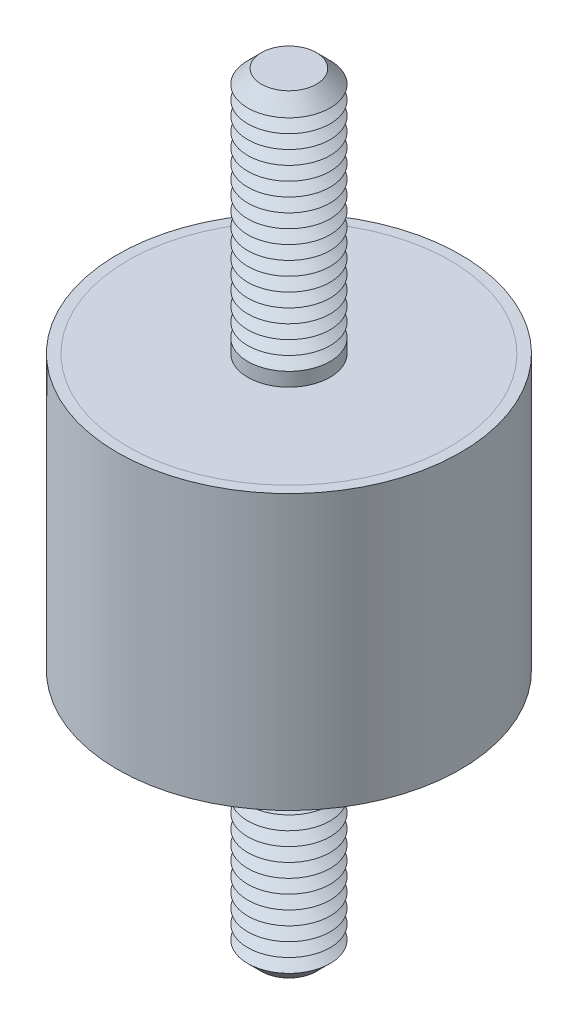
ISO-10303-21;
HEADER;
FILE_DESCRIPTION(('STEP AP214'),'2;1');
FILE_NAME('part.step','',(''),(''),'','','');
FILE_SCHEMA(('AUTOMOTIVE_DESIGN { 1 0 10303 214 1 1 1 1 }'));
ENDSEC;
DATA;
#1=APPLICATION_CONTEXT('core data for automotive mechanical design processes');
#2=APPLICATION_PROTOCOL_DEFINITION('international standard','automotive_design',2000,#1);
#3=PRODUCT_CONTEXT('',#1,'mechanical');
#4=PRODUCT('Part','Part','',(#3));
#5=PRODUCT_RELATED_PRODUCT_CATEGORY('part','',(#4));
#6=PRODUCT_DEFINITION_FORMATION('','',#4);
#7=PRODUCT_DEFINITION_CONTEXT('part definition',#1,'design');
#8=PRODUCT_DEFINITION('design','',#6,#7);
#9=PRODUCT_DEFINITION_SHAPE('','',#8);
#10=(LENGTH_UNIT() NAMED_UNIT(*) SI_UNIT(.MILLI.,.METRE.));
#11=(NAMED_UNIT(*) PLANE_ANGLE_UNIT() SI_UNIT($,.RADIAN.));
#12=(NAMED_UNIT(*) SI_UNIT($,.STERADIAN.) SOLID_ANGLE_UNIT());
#13=UNCERTAINTY_MEASURE_WITH_UNIT(LENGTH_MEASURE(1.E-05),#10,'distance_accuracy_value','');
#14=(GEOMETRIC_REPRESENTATION_CONTEXT(3) GLOBAL_UNCERTAINTY_ASSIGNED_CONTEXT((#13)) GLOBAL_UNIT_ASSIGNED_CONTEXT((#10,
#11,#12)) REPRESENTATION_CONTEXT('',''));
#15=CARTESIAN_POINT('',(0.,0.,0.));
#16=DIRECTION('',(0.,0.,1.));
#17=DIRECTION('',(1.,0.,0.));
#18=AXIS2_PLACEMENT_3D('',#15,#16,#17);
#19=CARTESIAN_POINT('',(0.,-28.,0.));
#20=DIRECTION('',(0.,1.,0.));
#21=DIRECTION('',(0.,0.,1.));
#22=AXIS2_PLACEMENT_3D('',#19,#20,#21);
#23=CYLINDRICAL_SURFACE('',#22,3.);
#24=CARTESIAN_POINT('',(0.,-10.,0.));
#25=DIRECTION('',(0.,-1.,0.));
#26=DIRECTION('',(0.,0.,-1.));
#27=AXIS2_PLACEMENT_3D('',#24,#25,#26);
#28=CIRCLE('',#27,3.);
#29=CARTESIAN_POINT('',(0.,-10.,-3.));
#30=VERTEX_POINT('',#29);
#31=EDGE_CURVE('P0_E21',#30,#30,#28,.T.);
#32=ORIENTED_EDGE('',*,*,#31,.T.);
#33=EDGE_LOOP('',(#32));
#34=FACE_BOUND('',#33,.T.);
#35=CARTESIAN_POINT('',(0.,-11.,0.));
#36=DIRECTION('',(0.,1.,0.));
#37=DIRECTION('',(0.,0.,1.));
#38=AXIS2_PLACEMENT_3D('',#35,#36,#37);
#39=CIRCLE('',#38,3.);
#40=CARTESIAN_POINT('',(0.,-11.,3.));
#41=VERTEX_POINT('',#40);
#42=EDGE_CURVE('P0_E33',#41,#41,#39,.T.);
#43=ORIENTED_EDGE('',*,*,#42,.T.);
#44=EDGE_LOOP('',(#43));
#45=FACE_BOUND('',#44,.T.);
#46=ADVANCED_FACE('P0_F14',(#34,#45),#23,.T.);
#47=CARTESIAN_POINT('',(0.,-10.,0.));
#48=DIRECTION('',(0.,1.,0.));
#49=DIRECTION('',(0.,0.,1.));
#50=AXIS2_PLACEMENT_3D('',#47,#48,#49);
#51=CYLINDRICAL_SURFACE('',#50,11.75);
#52=CARTESIAN_POINT('',(0.,-10.,0.));
#53=DIRECTION('',(0.,1.,0.));
#54=DIRECTION('',(0.,0.,1.));
#55=AXIS2_PLACEMENT_3D('',#52,#53,#54);
#56=CIRCLE('',#55,11.75);
#57=CARTESIAN_POINT('',(0.,-10.,11.75));
#58=VERTEX_POINT('',#57);
#59=EDGE_CURVE('P0_E25',#58,#58,#56,.T.);
#60=ORIENTED_EDGE('',*,*,#59,.T.);
#61=EDGE_LOOP('',(#60));
#62=FACE_BOUND('',#61,.T.);
#63=CARTESIAN_POINT('',(0.,-9.,0.));
#64=DIRECTION('',(0.,1.,0.));
#65=DIRECTION('',(0.,0.,1.));
#66=AXIS2_PLACEMENT_3D('',#63,#64,#65);
#67=CIRCLE('',#66,11.75);
#68=CARTESIAN_POINT('',(0.,-9.,11.75));
#69=VERTEX_POINT('',#68);
#70=EDGE_CURVE('P0_E30',#69,#69,#67,.T.);
#71=ORIENTED_EDGE('',*,*,#70,.F.);
#72=EDGE_LOOP('',(#71));
#73=FACE_BOUND('',#72,.T.);
#74=ADVANCED_FACE('P0_F157',(#62,#73),#51,.T.);
#75=CARTESIAN_POINT('',(0.,-10.,0.));
#76=DIRECTION('',(0.,1.,0.));
#77=DIRECTION('',(0.,0.,1.));
#78=AXIS2_PLACEMENT_3D('',#75,#76,#77);
#79=PLANE('',#78);
#80=ORIENTED_EDGE('',*,*,#31,.F.);
#81=EDGE_LOOP('',(#80));
#82=FACE_BOUND('',#81,.T.);
#83=ORIENTED_EDGE('',*,*,#59,.F.);
#84=EDGE_LOOP('',(#83));
#85=FACE_BOUND('',#84,.T.);
#86=ADVANCED_FACE('P0_F162',(#82,#85),#79,.F.);
#87=CARTESIAN_POINT('',(0.,-9.,0.));
#88=DIRECTION('',(0.,1.,0.));
#89=DIRECTION('',(0.,0.,1.));
#90=AXIS2_PLACEMENT_3D('',#87,#88,#89);
#91=PLANE('',#90);
#92=ORIENTED_EDGE('',*,*,#70,.T.);
#93=EDGE_LOOP('',(#92));
#94=FACE_BOUND('',#93,.T.);
#95=ADVANCED_FACE('P0_F168',(#94),#91,.T.);
#96=CARTESIAN_POINT('',(0.,-11.,0.));
#97=DIRECTION('',(0.,1.,0.));
#98=DIRECTION('',(0.,0.,1.));
#99=AXIS2_PLACEMENT_3D('',#96,#97,#98);
#100=CONICAL_SURFACE('',#99,3.,1.0471975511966);
#101=CARTESIAN_POINT('',(0.,-11.5,0.));
#102=DIRECTION('',(0.,1.,0.));
#103=DIRECTION('',(0.,0.,1.));
#104=AXIS2_PLACEMENT_3D('',#101,#102,#103);
#105=CIRCLE('',#104,2.13397459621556);
#106=CARTESIAN_POINT('',(0.,-11.5,2.13397459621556));
#107=VERTEX_POINT('',#106);
#108=EDGE_CURVE('P0_E39',#107,#107,#105,.T.);
#109=ORIENTED_EDGE('',*,*,#108,.T.);
#110=EDGE_LOOP('',(#109));
#111=FACE_BOUND('',#110,.T.);
#112=ORIENTED_EDGE('',*,*,#42,.F.);
#113=EDGE_LOOP('',(#112));
#114=FACE_BOUND('',#113,.T.);
#115=ADVANCED_FACE('P0_F171',(#111,#114),#100,.T.);
#116=CARTESIAN_POINT('',(0.,-11.5,0.));
#117=DIRECTION('',(0.,-1.,0.));
#118=DIRECTION('',(0.,0.,-1.));
#119=AXIS2_PLACEMENT_3D('',#116,#117,#118);
#120=CONICAL_SURFACE('',#119,2.13397459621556,1.0471975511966);
#121=CARTESIAN_POINT('',(0.,-12.,0.));
#122=DIRECTION('',(0.,1.,0.));
#123=DIRECTION('',(0.,0.,1.));
#124=AXIS2_PLACEMENT_3D('',#121,#122,#123);
#125=CIRCLE('',#124,3.);
#126=CARTESIAN_POINT('',(0.,-12.,3.));
#127=VERTEX_POINT('',#126);
#128=EDGE_CURVE('P0_E43',#127,#127,#125,.T.);
#129=ORIENTED_EDGE('',*,*,#128,.T.);
#130=EDGE_LOOP('',(#129));
#131=FACE_BOUND('',#130,.T.);
#132=ORIENTED_EDGE('',*,*,#108,.F.);
#133=EDGE_LOOP('',(#132));
#134=FACE_BOUND('',#133,.T.);
#135=ADVANCED_FACE('P0_F175',(#131,#134),#120,.T.);
#136=CARTESIAN_POINT('',(0.,-12.,0.));
#137=DIRECTION('',(0.,1.,0.));
#138=DIRECTION('',(0.,0.,1.));
#139=AXIS2_PLACEMENT_3D('',#136,#137,#138);
#140=CONICAL_SURFACE('',#139,3.,1.0471975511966);
#141=CARTESIAN_POINT('',(0.,-12.5,0.));
#142=DIRECTION('',(0.,1.,0.));
#143=DIRECTION('',(0.,0.,1.));
#144=AXIS2_PLACEMENT_3D('',#141,#142,#143);
#145=CIRCLE('',#144,2.13397459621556);
#146=CARTESIAN_POINT('',(0.,-12.5,2.13397459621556));
#147=VERTEX_POINT('',#146);
#148=EDGE_CURVE('P0_E47',#147,#147,#145,.T.);
#149=ORIENTED_EDGE('',*,*,#148,.T.);
#150=EDGE_LOOP('',(#149));
#151=FACE_BOUND('',#150,.T.);
#152=ORIENTED_EDGE('',*,*,#128,.F.);
#153=EDGE_LOOP('',(#152));
#154=FACE_BOUND('',#153,.T.);
#155=ADVANCED_FACE('P0_F179',(#151,#154),#140,.T.);
#156=CARTESIAN_POINT('',(0.,-12.5,0.));
#157=DIRECTION('',(0.,-1.,0.));
#158=DIRECTION('',(0.,0.,-1.));
#159=AXIS2_PLACEMENT_3D('',#156,#157,#158);
#160=CONICAL_SURFACE('',#159,2.13397459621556,1.0471975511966);
#161=CARTESIAN_POINT('',(0.,-13.,0.));
#162=DIRECTION('',(0.,1.,0.));
#163=DIRECTION('',(0.,0.,1.));
#164=AXIS2_PLACEMENT_3D('',#161,#162,#163);
#165=CIRCLE('',#164,3.);
#166=CARTESIAN_POINT('',(0.,-13.,3.));
#167=VERTEX_POINT('',#166);
#168=EDGE_CURVE('P0_E52',#167,#167,#165,.T.);
#169=ORIENTED_EDGE('',*,*,#168,.T.);
#170=EDGE_LOOP('',(#169));
#171=FACE_BOUND('',#170,.T.);
#172=ORIENTED_EDGE('',*,*,#148,.F.);
#173=EDGE_LOOP('',(#172));
#174=FACE_BOUND('',#173,.T.);
#175=ADVANCED_FACE('P0_F186',(#171,#174),#160,.T.);
#176=CARTESIAN_POINT('',(0.,-13.,0.));
#177=DIRECTION('',(0.,1.,0.));
#178=DIRECTION('',(0.,0.,1.));
#179=AXIS2_PLACEMENT_3D('',#176,#177,#178);
#180=CONICAL_SURFACE('',#179,3.,1.0471975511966);
#181=CARTESIAN_POINT('',(0.,-13.5,0.));
#182=DIRECTION('',(0.,1.,0.));
#183=DIRECTION('',(0.,0.,1.));
#184=AXIS2_PLACEMENT_3D('',#181,#182,#183);
#185=CIRCLE('',#184,2.13397459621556);
#186=CARTESIAN_POINT('',(0.,-13.5,2.13397459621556));
#187=VERTEX_POINT('',#186);
#188=EDGE_CURVE('P0_E55',#187,#187,#185,.T.);
#189=ORIENTED_EDGE('',*,*,#188,.T.);
#190=EDGE_LOOP('',(#189));
#191=FACE_BOUND('',#190,.T.);
#192=ORIENTED_EDGE('',*,*,#168,.F.);
#193=EDGE_LOOP('',(#192));
#194=FACE_BOUND('',#193,.T.);
#195=ADVANCED_FACE('P0_F190',(#191,#194),#180,.T.);
#196=CARTESIAN_POINT('',(0.,-13.5,0.));
#197=DIRECTION('',(0.,-1.,0.));
#198=DIRECTION('',(0.,0.,-1.));
#199=AXIS2_PLACEMENT_3D('',#196,#197,#198);
#200=CONICAL_SURFACE('',#199,2.13397459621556,1.0471975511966);
#201=CARTESIAN_POINT('',(0.,-14.,0.));
#202=DIRECTION('',(0.,1.,0.));
#203=DIRECTION('',(0.,0.,1.));
#204=AXIS2_PLACEMENT_3D('',#201,#202,#203);
#205=CIRCLE('',#204,3.);
#206=CARTESIAN_POINT('',(0.,-14.,3.));
#207=VERTEX_POINT('',#206);
#208=EDGE_CURVE('P0_E58',#207,#207,#205,.T.);
#209=ORIENTED_EDGE('',*,*,#208,.T.);
#210=EDGE_LOOP('',(#209));
#211=FACE_BOUND('',#210,.T.);
#212=ORIENTED_EDGE('',*,*,#188,.F.);
#213=EDGE_LOOP('',(#212));
#214=FACE_BOUND('',#213,.T.);
#215=ADVANCED_FACE('P0_F194',(#211,#214),#200,.T.);
#216=CARTESIAN_POINT('',(0.,-14.,0.));
#217=DIRECTION('',(0.,1.,0.));
#218=DIRECTION('',(0.,0.,1.));
#219=AXIS2_PLACEMENT_3D('',#216,#217,#218);
#220=CONICAL_SURFACE('',#219,3.,1.0471975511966);
#221=CARTESIAN_POINT('',(0.,-14.5,0.));
#222=DIRECTION('',(0.,1.,0.));
#223=DIRECTION('',(0.,0.,1.));
#224=AXIS2_PLACEMENT_3D('',#221,#222,#223);
#225=CIRCLE('',#224,2.13397459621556);
#226=CARTESIAN_POINT('',(0.,-14.5,2.13397459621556));
#227=VERTEX_POINT('',#226);
#228=EDGE_CURVE('P0_E61',#227,#227,#225,.T.);
#229=ORIENTED_EDGE('',*,*,#228,.T.);
#230=EDGE_LOOP('',(#229));
#231=FACE_BOUND('',#230,.T.);
#232=ORIENTED_EDGE('',*,*,#208,.F.);
#233=EDGE_LOOP('',(#232));
#234=FACE_BOUND('',#233,.T.);
#235=ADVANCED_FACE('P0_F198',(#231,#234),#220,.T.);
#236=CARTESIAN_POINT('',(0.,-14.5,0.));
#237=DIRECTION('',(0.,-1.,0.));
#238=DIRECTION('',(0.,0.,-1.));
#239=AXIS2_PLACEMENT_3D('',#236,#237,#238);
#240=CONICAL_SURFACE('',#239,2.13397459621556,1.0471975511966);
#241=CARTESIAN_POINT('',(0.,-15.,0.));
#242=DIRECTION('',(0.,1.,0.));
#243=DIRECTION('',(0.,0.,1.));
#244=AXIS2_PLACEMENT_3D('',#241,#242,#243);
#245=CIRCLE('',#244,3.);
#246=CARTESIAN_POINT('',(0.,-15.,3.));
#247=VERTEX_POINT('',#246);
#248=EDGE_CURVE('P0_E64',#247,#247,#245,.T.);
#249=ORIENTED_EDGE('',*,*,#248,.T.);
#250=EDGE_LOOP('',(#249));
#251=FACE_BOUND('',#250,.T.);
#252=ORIENTED_EDGE('',*,*,#228,.F.);
#253=EDGE_LOOP('',(#252));
#254=FACE_BOUND('',#253,.T.);
#255=ADVANCED_FACE('P0_F202',(#251,#254),#240,.T.);
#256=CARTESIAN_POINT('',(0.,-15.,0.));
#257=DIRECTION('',(0.,1.,0.));
#258=DIRECTION('',(0.,0.,1.));
#259=AXIS2_PLACEMENT_3D('',#256,#257,#258);
#260=CONICAL_SURFACE('',#259,3.,1.0471975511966);
#261=CARTESIAN_POINT('',(0.,-15.5,0.));
#262=DIRECTION('',(0.,1.,0.));
#263=DIRECTION('',(0.,0.,1.));
#264=AXIS2_PLACEMENT_3D('',#261,#262,#263);
#265=CIRCLE('',#264,2.13397459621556);
#266=CARTESIAN_POINT('',(0.,-15.5,2.13397459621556));
#267=VERTEX_POINT('',#266);
#268=EDGE_CURVE('P0_E67',#267,#267,#265,.T.);
#269=ORIENTED_EDGE('',*,*,#268,.T.);
#270=EDGE_LOOP('',(#269));
#271=FACE_BOUND('',#270,.T.);
#272=ORIENTED_EDGE('',*,*,#248,.F.);
#273=EDGE_LOOP('',(#272));
#274=FACE_BOUND('',#273,.T.);
#275=ADVANCED_FACE('P0_F206',(#271,#274),#260,.T.);
#276=CARTESIAN_POINT('',(0.,-15.5,0.));
#277=DIRECTION('',(0.,-1.,0.));
#278=DIRECTION('',(0.,0.,-1.));
#279=AXIS2_PLACEMENT_3D('',#276,#277,#278);
#280=CONICAL_SURFACE('',#279,2.13397459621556,1.0471975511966);
#281=CARTESIAN_POINT('',(0.,-16.,0.));
#282=DIRECTION('',(0.,1.,0.));
#283=DIRECTION('',(0.,0.,1.));
#284=AXIS2_PLACEMENT_3D('',#281,#282,#283);
#285=CIRCLE('',#284,3.);
#286=CARTESIAN_POINT('',(0.,-16.,3.));
#287=VERTEX_POINT('',#286);
#288=EDGE_CURVE('P0_E70',#287,#287,#285,.T.);
#289=ORIENTED_EDGE('',*,*,#288,.T.);
#290=EDGE_LOOP('',(#289));
#291=FACE_BOUND('',#290,.T.);
#292=ORIENTED_EDGE('',*,*,#268,.F.);
#293=EDGE_LOOP('',(#292));
#294=FACE_BOUND('',#293,.T.);
#295=ADVANCED_FACE('P0_F210',(#291,#294),#280,.T.);
#296=CARTESIAN_POINT('',(0.,-16.,0.));
#297=DIRECTION('',(0.,1.,0.));
#298=DIRECTION('',(0.,0.,1.));
#299=AXIS2_PLACEMENT_3D('',#296,#297,#298);
#300=CONICAL_SURFACE('',#299,3.,1.0471975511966);
#301=CARTESIAN_POINT('',(0.,-16.5,0.));
#302=DIRECTION('',(0.,1.,0.));
#303=DIRECTION('',(0.,0.,1.));
#304=AXIS2_PLACEMENT_3D('',#301,#302,#303);
#305=CIRCLE('',#304,2.13397459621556);
#306=CARTESIAN_POINT('',(0.,-16.5,2.13397459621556));
#307=VERTEX_POINT('',#306);
#308=EDGE_CURVE('P0_E73',#307,#307,#305,.T.);
#309=ORIENTED_EDGE('',*,*,#308,.T.);
#310=EDGE_LOOP('',(#309));
#311=FACE_BOUND('',#310,.T.);
#312=ORIENTED_EDGE('',*,*,#288,.F.);
#313=EDGE_LOOP('',(#312));
#314=FACE_BOUND('',#313,.T.);
#315=ADVANCED_FACE('P0_F214',(#311,#314),#300,.T.);
#316=CARTESIAN_POINT('',(0.,-16.5,0.));
#317=DIRECTION('',(0.,-1.,0.));
#318=DIRECTION('',(0.,0.,-1.));
#319=AXIS2_PLACEMENT_3D('',#316,#317,#318);
#320=CONICAL_SURFACE('',#319,2.13397459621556,1.0471975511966);
#321=CARTESIAN_POINT('',(0.,-17.,0.));
#322=DIRECTION('',(0.,1.,0.));
#323=DIRECTION('',(0.,0.,1.));
#324=AXIS2_PLACEMENT_3D('',#321,#322,#323);
#325=CIRCLE('',#324,3.);
#326=CARTESIAN_POINT('',(0.,-17.,3.));
#327=VERTEX_POINT('',#326);
#328=EDGE_CURVE('P0_E76',#327,#327,#325,.T.);
#329=ORIENTED_EDGE('',*,*,#328,.T.);
#330=EDGE_LOOP('',(#329));
#331=FACE_BOUND('',#330,.T.);
#332=ORIENTED_EDGE('',*,*,#308,.F.);
#333=EDGE_LOOP('',(#332));
#334=FACE_BOUND('',#333,.T.);
#335=ADVANCED_FACE('P0_F218',(#331,#334),#320,.T.);
#336=CARTESIAN_POINT('',(0.,-17.,0.));
#337=DIRECTION('',(0.,1.,0.));
#338=DIRECTION('',(0.,0.,1.));
#339=AXIS2_PLACEMENT_3D('',#336,#337,#338);
#340=CONICAL_SURFACE('',#339,3.,1.0471975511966);
#341=CARTESIAN_POINT('',(0.,-17.5,0.));
#342=DIRECTION('',(0.,1.,0.));
#343=DIRECTION('',(0.,0.,1.));
#344=AXIS2_PLACEMENT_3D('',#341,#342,#343);
#345=CIRCLE('',#344,2.13397459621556);
#346=CARTESIAN_POINT('',(0.,-17.5,2.13397459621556));
#347=VERTEX_POINT('',#346);
#348=EDGE_CURVE('P0_E79',#347,#347,#345,.T.);
#349=ORIENTED_EDGE('',*,*,#348,.T.);
#350=EDGE_LOOP('',(#349));
#351=FACE_BOUND('',#350,.T.);
#352=ORIENTED_EDGE('',*,*,#328,.F.);
#353=EDGE_LOOP('',(#352));
#354=FACE_BOUND('',#353,.T.);
#355=ADVANCED_FACE('P0_F222',(#351,#354),#340,.T.);
#356=CARTESIAN_POINT('',(0.,-17.5,0.));
#357=DIRECTION('',(0.,-1.,0.));
#358=DIRECTION('',(0.,0.,-1.));
#359=AXIS2_PLACEMENT_3D('',#356,#357,#358);
#360=CONICAL_SURFACE('',#359,2.13397459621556,1.0471975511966);
#361=CARTESIAN_POINT('',(0.,-18.,0.));
#362=DIRECTION('',(0.,1.,0.));
#363=DIRECTION('',(0.,0.,1.));
#364=AXIS2_PLACEMENT_3D('',#361,#362,#363);
#365=CIRCLE('',#364,3.);
#366=CARTESIAN_POINT('',(0.,-18.,3.));
#367=VERTEX_POINT('',#366);
#368=EDGE_CURVE('P0_E82',#367,#367,#365,.T.);
#369=ORIENTED_EDGE('',*,*,#368,.T.);
#370=EDGE_LOOP('',(#369));
#371=FACE_BOUND('',#370,.T.);
#372=ORIENTED_EDGE('',*,*,#348,.F.);
#373=EDGE_LOOP('',(#372));
#374=FACE_BOUND('',#373,.T.);
#375=ADVANCED_FACE('P0_F226',(#371,#374),#360,.T.);
#376=CARTESIAN_POINT('',(0.,-18.,0.));
#377=DIRECTION('',(0.,1.,0.));
#378=DIRECTION('',(0.,0.,1.));
#379=AXIS2_PLACEMENT_3D('',#376,#377,#378);
#380=CONICAL_SURFACE('',#379,3.,1.0471975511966);
#381=CARTESIAN_POINT('',(0.,-18.5,0.));
#382=DIRECTION('',(0.,1.,0.));
#383=DIRECTION('',(0.,0.,1.));
#384=AXIS2_PLACEMENT_3D('',#381,#382,#383);
#385=CIRCLE('',#384,2.13397459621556);
#386=CARTESIAN_POINT('',(0.,-18.5,2.13397459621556));
#387=VERTEX_POINT('',#386);
#388=EDGE_CURVE('P0_E85',#387,#387,#385,.T.);
#389=ORIENTED_EDGE('',*,*,#388,.T.);
#390=EDGE_LOOP('',(#389));
#391=FACE_BOUND('',#390,.T.);
#392=ORIENTED_EDGE('',*,*,#368,.F.);
#393=EDGE_LOOP('',(#392));
#394=FACE_BOUND('',#393,.T.);
#395=ADVANCED_FACE('P0_F230',(#391,#394),#380,.T.);
#396=CARTESIAN_POINT('',(0.,-18.5,0.));
#397=DIRECTION('',(0.,-1.,0.));
#398=DIRECTION('',(0.,0.,-1.));
#399=AXIS2_PLACEMENT_3D('',#396,#397,#398);
#400=CONICAL_SURFACE('',#399,2.13397459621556,1.0471975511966);
#401=CARTESIAN_POINT('',(0.,-19.,0.));
#402=DIRECTION('',(0.,1.,0.));
#403=DIRECTION('',(0.,0.,1.));
#404=AXIS2_PLACEMENT_3D('',#401,#402,#403);
#405=CIRCLE('',#404,3.);
#406=CARTESIAN_POINT('',(0.,-19.,3.));
#407=VERTEX_POINT('',#406);
#408=EDGE_CURVE('P0_E88',#407,#407,#405,.T.);
#409=ORIENTED_EDGE('',*,*,#408,.T.);
#410=EDGE_LOOP('',(#409));
#411=FACE_BOUND('',#410,.T.);
#412=ORIENTED_EDGE('',*,*,#388,.F.);
#413=EDGE_LOOP('',(#412));
#414=FACE_BOUND('',#413,.T.);
#415=ADVANCED_FACE('P0_F234',(#411,#414),#400,.T.);
#416=CARTESIAN_POINT('',(0.,-19.,0.));
#417=DIRECTION('',(0.,1.,0.));
#418=DIRECTION('',(0.,0.,1.));
#419=AXIS2_PLACEMENT_3D('',#416,#417,#418);
#420=CONICAL_SURFACE('',#419,3.,1.0471975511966);
#421=CARTESIAN_POINT('',(0.,-19.5,0.));
#422=DIRECTION('',(0.,1.,0.));
#423=DIRECTION('',(0.,0.,1.));
#424=AXIS2_PLACEMENT_3D('',#421,#422,#423);
#425=CIRCLE('',#424,2.13397459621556);
#426=CARTESIAN_POINT('',(0.,-19.5,2.13397459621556));
#427=VERTEX_POINT('',#426);
#428=EDGE_CURVE('P0_E91',#427,#427,#425,.T.);
#429=ORIENTED_EDGE('',*,*,#428,.T.);
#430=EDGE_LOOP('',(#429));
#431=FACE_BOUND('',#430,.T.);
#432=ORIENTED_EDGE('',*,*,#408,.F.);
#433=EDGE_LOOP('',(#432));
#434=FACE_BOUND('',#433,.T.);
#435=ADVANCED_FACE('P0_F238',(#431,#434),#420,.T.);
#436=CARTESIAN_POINT('',(0.,-19.5,0.));
#437=DIRECTION('',(0.,-1.,0.));
#438=DIRECTION('',(0.,0.,-1.));
#439=AXIS2_PLACEMENT_3D('',#436,#437,#438);
#440=CONICAL_SURFACE('',#439,2.13397459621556,1.0471975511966);
#441=CARTESIAN_POINT('',(0.,-20.,0.));
#442=DIRECTION('',(0.,1.,0.));
#443=DIRECTION('',(0.,0.,1.));
#444=AXIS2_PLACEMENT_3D('',#441,#442,#443);
#445=CIRCLE('',#444,3.);
#446=CARTESIAN_POINT('',(0.,-20.,3.));
#447=VERTEX_POINT('',#446);
#448=EDGE_CURVE('P0_E94',#447,#447,#445,.T.);
#449=ORIENTED_EDGE('',*,*,#448,.T.);
#450=EDGE_LOOP('',(#449));
#451=FACE_BOUND('',#450,.T.);
#452=ORIENTED_EDGE('',*,*,#428,.F.);
#453=EDGE_LOOP('',(#452));
#454=FACE_BOUND('',#453,.T.);
#455=ADVANCED_FACE('P0_F242',(#451,#454),#440,.T.);
#456=CARTESIAN_POINT('',(0.,-20.,0.));
#457=DIRECTION('',(0.,1.,0.));
#458=DIRECTION('',(0.,0.,1.));
#459=AXIS2_PLACEMENT_3D('',#456,#457,#458);
#460=CONICAL_SURFACE('',#459,3.,1.0471975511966);
#461=CARTESIAN_POINT('',(0.,-20.5,0.));
#462=DIRECTION('',(0.,1.,0.));
#463=DIRECTION('',(0.,0.,1.));
#464=AXIS2_PLACEMENT_3D('',#461,#462,#463);
#465=CIRCLE('',#464,2.13397459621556);
#466=CARTESIAN_POINT('',(0.,-20.5,2.13397459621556));
#467=VERTEX_POINT('',#466);
#468=EDGE_CURVE('P0_E97',#467,#467,#465,.T.);
#469=ORIENTED_EDGE('',*,*,#468,.T.);
#470=EDGE_LOOP('',(#469));
#471=FACE_BOUND('',#470,.T.);
#472=ORIENTED_EDGE('',*,*,#448,.F.);
#473=EDGE_LOOP('',(#472));
#474=FACE_BOUND('',#473,.T.);
#475=ADVANCED_FACE('P0_F246',(#471,#474),#460,.T.);
#476=CARTESIAN_POINT('',(0.,-20.5,0.));
#477=DIRECTION('',(0.,-1.,0.));
#478=DIRECTION('',(0.,0.,-1.));
#479=AXIS2_PLACEMENT_3D('',#476,#477,#478);
#480=CONICAL_SURFACE('',#479,2.13397459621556,1.0471975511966);
#481=CARTESIAN_POINT('',(0.,-21.,0.));
#482=DIRECTION('',(0.,1.,0.));
#483=DIRECTION('',(0.,0.,1.));
#484=AXIS2_PLACEMENT_3D('',#481,#482,#483);
#485=CIRCLE('',#484,3.);
#486=CARTESIAN_POINT('',(0.,-21.,3.));
#487=VERTEX_POINT('',#486);
#488=EDGE_CURVE('P0_E100',#487,#487,#485,.T.);
#489=ORIENTED_EDGE('',*,*,#488,.T.);
#490=EDGE_LOOP('',(#489));
#491=FACE_BOUND('',#490,.T.);
#492=ORIENTED_EDGE('',*,*,#468,.F.);
#493=EDGE_LOOP('',(#492));
#494=FACE_BOUND('',#493,.T.);
#495=ADVANCED_FACE('P0_F250',(#491,#494),#480,.T.);
#496=CARTESIAN_POINT('',(0.,-21.,0.));
#497=DIRECTION('',(0.,1.,0.));
#498=DIRECTION('',(0.,0.,1.));
#499=AXIS2_PLACEMENT_3D('',#496,#497,#498);
#500=CONICAL_SURFACE('',#499,3.,1.0471975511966);
#501=CARTESIAN_POINT('',(0.,-21.5,0.));
#502=DIRECTION('',(0.,1.,0.));
#503=DIRECTION('',(0.,0.,1.));
#504=AXIS2_PLACEMENT_3D('',#501,#502,#503);
#505=CIRCLE('',#504,2.13397459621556);
#506=CARTESIAN_POINT('',(0.,-21.5,2.13397459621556));
#507=VERTEX_POINT('',#506);
#508=EDGE_CURVE('P0_E103',#507,#507,#505,.T.);
#509=ORIENTED_EDGE('',*,*,#508,.T.);
#510=EDGE_LOOP('',(#509));
#511=FACE_BOUND('',#510,.T.);
#512=ORIENTED_EDGE('',*,*,#488,.F.);
#513=EDGE_LOOP('',(#512));
#514=FACE_BOUND('',#513,.T.);
#515=ADVANCED_FACE('P0_F254',(#511,#514),#500,.T.);
#516=CARTESIAN_POINT('',(0.,-21.5,0.));
#517=DIRECTION('',(0.,-1.,0.));
#518=DIRECTION('',(0.,0.,-1.));
#519=AXIS2_PLACEMENT_3D('',#516,#517,#518);
#520=CONICAL_SURFACE('',#519,2.13397459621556,1.0471975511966);
#521=CARTESIAN_POINT('',(0.,-22.,0.));
#522=DIRECTION('',(0.,1.,0.));
#523=DIRECTION('',(0.,0.,1.));
#524=AXIS2_PLACEMENT_3D('',#521,#522,#523);
#525=CIRCLE('',#524,3.);
#526=CARTESIAN_POINT('',(0.,-22.,3.));
#527=VERTEX_POINT('',#526);
#528=EDGE_CURVE('P0_E106',#527,#527,#525,.T.);
#529=ORIENTED_EDGE('',*,*,#528,.T.);
#530=EDGE_LOOP('',(#529));
#531=FACE_BOUND('',#530,.T.);
#532=ORIENTED_EDGE('',*,*,#508,.F.);
#533=EDGE_LOOP('',(#532));
#534=FACE_BOUND('',#533,.T.);
#535=ADVANCED_FACE('P0_F258',(#531,#534),#520,.T.);
#536=CARTESIAN_POINT('',(0.,-22.,0.));
#537=DIRECTION('',(0.,1.,0.));
#538=DIRECTION('',(0.,0.,1.));
#539=AXIS2_PLACEMENT_3D('',#536,#537,#538);
#540=CONICAL_SURFACE('',#539,3.,1.0471975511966);
#541=CARTESIAN_POINT('',(0.,-22.5,0.));
#542=DIRECTION('',(0.,1.,0.));
#543=DIRECTION('',(0.,0.,1.));
#544=AXIS2_PLACEMENT_3D('',#541,#542,#543);
#545=CIRCLE('',#544,2.13397459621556);
#546=CARTESIAN_POINT('',(0.,-22.5,2.13397459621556));
#547=VERTEX_POINT('',#546);
#548=EDGE_CURVE('P0_E109',#547,#547,#545,.T.);
#549=ORIENTED_EDGE('',*,*,#548,.T.);
#550=EDGE_LOOP('',(#549));
#551=FACE_BOUND('',#550,.T.);
#552=ORIENTED_EDGE('',*,*,#528,.F.);
#553=EDGE_LOOP('',(#552));
#554=FACE_BOUND('',#553,.T.);
#555=ADVANCED_FACE('P0_F262',(#551,#554),#540,.T.);
#556=CARTESIAN_POINT('',(0.,-22.5,0.));
#557=DIRECTION('',(0.,-1.,0.));
#558=DIRECTION('',(0.,0.,-1.));
#559=AXIS2_PLACEMENT_3D('',#556,#557,#558);
#560=CONICAL_SURFACE('',#559,2.13397459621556,1.0471975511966);
#561=CARTESIAN_POINT('',(0.,-23.,0.));
#562=DIRECTION('',(0.,1.,0.));
#563=DIRECTION('',(0.,0.,1.));
#564=AXIS2_PLACEMENT_3D('',#561,#562,#563);
#565=CIRCLE('',#564,3.);
#566=CARTESIAN_POINT('',(0.,-23.,3.));
#567=VERTEX_POINT('',#566);
#568=EDGE_CURVE('P0_E112',#567,#567,#565,.T.);
#569=ORIENTED_EDGE('',*,*,#568,.T.);
#570=EDGE_LOOP('',(#569));
#571=FACE_BOUND('',#570,.T.);
#572=ORIENTED_EDGE('',*,*,#548,.F.);
#573=EDGE_LOOP('',(#572));
#574=FACE_BOUND('',#573,.T.);
#575=ADVANCED_FACE('P0_F266',(#571,#574),#560,.T.);
#576=CARTESIAN_POINT('',(0.,-23.,0.));
#577=DIRECTION('',(0.,1.,0.));
#578=DIRECTION('',(0.,0.,1.));
#579=AXIS2_PLACEMENT_3D('',#576,#577,#578);
#580=CONICAL_SURFACE('',#579,3.,1.0471975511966);
#581=CARTESIAN_POINT('',(0.,-23.5,0.));
#582=DIRECTION('',(0.,1.,0.));
#583=DIRECTION('',(0.,0.,1.));
#584=AXIS2_PLACEMENT_3D('',#581,#582,#583);
#585=CIRCLE('',#584,2.13397459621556);
#586=CARTESIAN_POINT('',(0.,-23.5,2.13397459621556));
#587=VERTEX_POINT('',#586);
#588=EDGE_CURVE('P0_E115',#587,#587,#585,.T.);
#589=ORIENTED_EDGE('',*,*,#588,.T.);
#590=EDGE_LOOP('',(#589));
#591=FACE_BOUND('',#590,.T.);
#592=ORIENTED_EDGE('',*,*,#568,.F.);
#593=EDGE_LOOP('',(#592));
#594=FACE_BOUND('',#593,.T.);
#595=ADVANCED_FACE('P0_F270',(#591,#594),#580,.T.);
#596=CARTESIAN_POINT('',(0.,-23.5,0.));
#597=DIRECTION('',(0.,-1.,0.));
#598=DIRECTION('',(0.,0.,-1.));
#599=AXIS2_PLACEMENT_3D('',#596,#597,#598);
#600=CONICAL_SURFACE('',#599,2.13397459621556,1.0471975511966);
#601=CARTESIAN_POINT('',(0.,-24.,0.));
#602=DIRECTION('',(0.,1.,0.));
#603=DIRECTION('',(0.,0.,1.));
#604=AXIS2_PLACEMENT_3D('',#601,#602,#603);
#605=CIRCLE('',#604,3.);
#606=CARTESIAN_POINT('',(0.,-24.,3.));
#607=VERTEX_POINT('',#606);
#608=EDGE_CURVE('P0_E118',#607,#607,#605,.T.);
#609=ORIENTED_EDGE('',*,*,#608,.T.);
#610=EDGE_LOOP('',(#609));
#611=FACE_BOUND('',#610,.T.);
#612=ORIENTED_EDGE('',*,*,#588,.F.);
#613=EDGE_LOOP('',(#612));
#614=FACE_BOUND('',#613,.T.);
#615=ADVANCED_FACE('P0_F274',(#611,#614),#600,.T.);
#616=CARTESIAN_POINT('',(0.,-24.,0.));
#617=DIRECTION('',(0.,1.,0.));
#618=DIRECTION('',(0.,0.,1.));
#619=AXIS2_PLACEMENT_3D('',#616,#617,#618);
#620=CONICAL_SURFACE('',#619,3.,1.0471975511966);
#621=CARTESIAN_POINT('',(0.,-24.5,0.));
#622=DIRECTION('',(0.,1.,0.));
#623=DIRECTION('',(0.,0.,1.));
#624=AXIS2_PLACEMENT_3D('',#621,#622,#623);
#625=CIRCLE('',#624,2.13397459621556);
#626=CARTESIAN_POINT('',(0.,-24.5,2.13397459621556));
#627=VERTEX_POINT('',#626);
#628=EDGE_CURVE('P0_E121',#627,#627,#625,.T.);
#629=ORIENTED_EDGE('',*,*,#628,.T.);
#630=EDGE_LOOP('',(#629));
#631=FACE_BOUND('',#630,.T.);
#632=ORIENTED_EDGE('',*,*,#608,.F.);
#633=EDGE_LOOP('',(#632));
#634=FACE_BOUND('',#633,.T.);
#635=ADVANCED_FACE('P0_F278',(#631,#634),#620,.T.);
#636=CARTESIAN_POINT('',(0.,-24.5,0.));
#637=DIRECTION('',(0.,-1.,0.));
#638=DIRECTION('',(0.,0.,-1.));
#639=AXIS2_PLACEMENT_3D('',#636,#637,#638);
#640=CONICAL_SURFACE('',#639,2.13397459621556,1.0471975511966);
#641=CARTESIAN_POINT('',(0.,-25.,0.));
#642=DIRECTION('',(0.,1.,0.));
#643=DIRECTION('',(0.,0.,1.));
#644=AXIS2_PLACEMENT_3D('',#641,#642,#643);
#645=CIRCLE('',#644,3.);
#646=CARTESIAN_POINT('',(0.,-25.,3.));
#647=VERTEX_POINT('',#646);
#648=EDGE_CURVE('P0_E124',#647,#647,#645,.T.);
#649=ORIENTED_EDGE('',*,*,#648,.T.);
#650=EDGE_LOOP('',(#649));
#651=FACE_BOUND('',#650,.T.);
#652=ORIENTED_EDGE('',*,*,#628,.F.);
#653=EDGE_LOOP('',(#652));
#654=FACE_BOUND('',#653,.T.);
#655=ADVANCED_FACE('P0_F282',(#651,#654),#640,.T.);
#656=CARTESIAN_POINT('',(0.,-25.,0.));
#657=DIRECTION('',(0.,1.,0.));
#658=DIRECTION('',(0.,0.,1.));
#659=AXIS2_PLACEMENT_3D('',#656,#657,#658);
#660=CONICAL_SURFACE('',#659,3.,1.0471975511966);
#661=CARTESIAN_POINT('',(0.,-25.5,0.));
#662=DIRECTION('',(0.,1.,0.));
#663=DIRECTION('',(0.,0.,1.));
#664=AXIS2_PLACEMENT_3D('',#661,#662,#663);
#665=CIRCLE('',#664,2.13397459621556);
#666=CARTESIAN_POINT('',(0.,-25.5,2.13397459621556));
#667=VERTEX_POINT('',#666);
#668=EDGE_CURVE('P0_E127',#667,#667,#665,.T.);
#669=ORIENTED_EDGE('',*,*,#668,.T.);
#670=EDGE_LOOP('',(#669));
#671=FACE_BOUND('',#670,.T.);
#672=ORIENTED_EDGE('',*,*,#648,.F.);
#673=EDGE_LOOP('',(#672));
#674=FACE_BOUND('',#673,.T.);
#675=ADVANCED_FACE('P0_F286',(#671,#674),#660,.T.);
#676=CARTESIAN_POINT('',(0.,-25.5,0.));
#677=DIRECTION('',(0.,-1.,0.));
#678=DIRECTION('',(0.,0.,-1.));
#679=AXIS2_PLACEMENT_3D('',#676,#677,#678);
#680=CONICAL_SURFACE('',#679,2.13397459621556,1.0471975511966);
#681=CARTESIAN_POINT('',(0.,-26.,0.));
#682=DIRECTION('',(0.,1.,0.));
#683=DIRECTION('',(0.,0.,1.));
#684=AXIS2_PLACEMENT_3D('',#681,#682,#683);
#685=CIRCLE('',#684,3.);
#686=CARTESIAN_POINT('',(0.,-26.,3.));
#687=VERTEX_POINT('',#686);
#688=EDGE_CURVE('P0_E130',#687,#687,#685,.T.);
#689=ORIENTED_EDGE('',*,*,#688,.T.);
#690=EDGE_LOOP('',(#689));
#691=FACE_BOUND('',#690,.T.);
#692=ORIENTED_EDGE('',*,*,#668,.F.);
#693=EDGE_LOOP('',(#692));
#694=FACE_BOUND('',#693,.T.);
#695=ADVANCED_FACE('P0_F154',(#691,#694),#680,.T.);
#696=CARTESIAN_POINT('',(0.,-26.,0.));
#697=DIRECTION('',(0.,1.,0.));
#698=DIRECTION('',(0.,0.,1.));
#699=AXIS2_PLACEMENT_3D('',#696,#697,#698);
#700=CONICAL_SURFACE('',#699,3.,1.0471975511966);
#701=CARTESIAN_POINT('',(0.,-26.5,0.));
#702=DIRECTION('',(0.,1.,0.));
#703=DIRECTION('',(0.,0.,1.));
#704=AXIS2_PLACEMENT_3D('',#701,#702,#703);
#705=CIRCLE('',#704,2.13397459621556);
#706=CARTESIAN_POINT('',(0.,-26.5,2.13397459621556));
#707=VERTEX_POINT('',#706);
#708=EDGE_CURVE('P0_E136',#707,#707,#705,.T.);
#709=ORIENTED_EDGE('',*,*,#708,.T.);
#710=EDGE_LOOP('',(#709));
#711=FACE_BOUND('',#710,.T.);
#712=ORIENTED_EDGE('',*,*,#688,.F.);
#713=EDGE_LOOP('',(#712));
#714=FACE_BOUND('',#713,.T.);
#715=ADVANCED_FACE('P0_F140',(#711,#714),#700,.T.);
#716=CARTESIAN_POINT('',(0.,-26.5,0.));
#717=DIRECTION('',(0.,-1.,0.));
#718=DIRECTION('',(0.,0.,-1.));
#719=AXIS2_PLACEMENT_3D('',#716,#717,#718);
#720=CONICAL_SURFACE('',#719,2.13397459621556,1.0471975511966);
#721=CARTESIAN_POINT('',(0.,-27.,0.));
#722=DIRECTION('',(0.,1.,0.));
#723=DIRECTION('',(0.,0.,1.));
#724=AXIS2_PLACEMENT_3D('',#721,#722,#723);
#725=CIRCLE('',#724,3.);
#726=CARTESIAN_POINT('',(0.,-27.,3.));
#727=VERTEX_POINT('',#726);
#728=EDGE_CURVE('P0_E133',#727,#727,#725,.T.);
#729=ORIENTED_EDGE('',*,*,#728,.T.);
#730=EDGE_LOOP('',(#729));
#731=FACE_BOUND('',#730,.T.);
#732=ORIENTED_EDGE('',*,*,#708,.F.);
#733=EDGE_LOOP('',(#732));
#734=FACE_BOUND('',#733,.T.);
#735=ADVANCED_FACE('P0_F143',(#731,#734),#720,.T.);
#736=CARTESIAN_POINT('',(0.,-28.,0.));
#737=DIRECTION('',(0.,-1.,0.));
#738=DIRECTION('',(0.,0.,-1.));
#739=AXIS2_PLACEMENT_3D('',#736,#737,#738);
#740=PLANE('',#739);
#741=CARTESIAN_POINT('',(0.,-28.,0.));
#742=DIRECTION('',(0.,-1.,0.));
#743=DIRECTION('',(0.,0.,-1.));
#744=AXIS2_PLACEMENT_3D('',#741,#742,#743);
#745=CIRCLE('',#744,2.);
#746=CARTESIAN_POINT('',(0.,-28.,-2.));
#747=VERTEX_POINT('',#746);
#748=EDGE_CURVE('P0_E10',#747,#747,#745,.T.);
#749=ORIENTED_EDGE('',*,*,#748,.T.);
#750=EDGE_LOOP('',(#749));
#751=FACE_BOUND('',#750,.T.);
#752=ADVANCED_FACE('P0_F145',(#751),#740,.T.);
#753=CARTESIAN_POINT('',(0.,-28.,0.));
#754=DIRECTION('',(0.,1.,0.));
#755=DIRECTION('',(0.,0.,1.));
#756=AXIS2_PLACEMENT_3D('',#753,#754,#755);
#757=CONICAL_SURFACE('',#756,2.,0.785398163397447);
#758=ORIENTED_EDGE('',*,*,#728,.F.);
#759=EDGE_LOOP('',(#758));
#760=FACE_BOUND('',#759,.T.);
#761=ORIENTED_EDGE('',*,*,#748,.F.);
#762=EDGE_LOOP('',(#761));
#763=FACE_BOUND('',#762,.T.);
#764=ADVANCED_FACE('P0_F16',(#760,#763),#757,.T.);
#765=CLOSED_SHELL('',(#46,#74,#86,#95,#115,#135,#155,#175,#195,#215,#235,#255,#275,#295,#315,
#335,#355,#375,#395,#415,#435,#455,#475,#495,#515,#535,#555,#575,#595,#615,#635,#655,#675,#695,
#715,#735,#752,#764));
#766=MANIFOLD_SOLID_BREP('P0_B1',#765);
#767=CARTESIAN_POINT('',(0.,28.,0.));
#768=DIRECTION('',(0.,-1.,0.));
#769=DIRECTION('',(0.,0.,-1.));
#770=AXIS2_PLACEMENT_3D('',#767,#768,#769);
#771=CYLINDRICAL_SURFACE('',#770,3.);
#772=CARTESIAN_POINT('',(0.,11.,0.));
#773=DIRECTION('',(0.,1.,0.));
#774=DIRECTION('',(0.,0.,1.));
#775=AXIS2_PLACEMENT_3D('',#772,#773,#774);
#776=CIRCLE('',#775,3.);
#777=CARTESIAN_POINT('',(0.,11.,3.));
#778=VERTEX_POINT('',#777);
#779=EDGE_CURVE('P1_E33',#778,#778,#776,.T.);
#780=ORIENTED_EDGE('',*,*,#779,.F.);
#781=EDGE_LOOP('',(#780));
#782=FACE_BOUND('',#781,.T.);
#783=CARTESIAN_POINT('',(0.,10.,0.));
#784=DIRECTION('',(0.,1.,0.));
#785=DIRECTION('',(0.,0.,1.));
#786=AXIS2_PLACEMENT_3D('',#783,#784,#785);
#787=CIRCLE('',#786,3.);
#788=CARTESIAN_POINT('',(0.,10.,3.));
#789=VERTEX_POINT('',#788);
#790=EDGE_CURVE('P1_E21',#789,#789,#787,.T.);
#791=ORIENTED_EDGE('',*,*,#790,.T.);
#792=EDGE_LOOP('',(#791));
#793=FACE_BOUND('',#792,.T.);
#794=ADVANCED_FACE('P1_F14',(#782,#793),#771,.T.);
#795=CARTESIAN_POINT('',(0.,10.,0.));
#796=DIRECTION('',(0.,-1.,0.));
#797=DIRECTION('',(0.,0.,-1.));
#798=AXIS2_PLACEMENT_3D('',#795,#796,#797);
#799=CYLINDRICAL_SURFACE('',#798,11.75);
#800=CARTESIAN_POINT('',(0.,10.,0.));
#801=DIRECTION('',(0.,1.,0.));
#802=DIRECTION('',(0.,0.,1.));
#803=AXIS2_PLACEMENT_3D('',#800,#801,#802);
#804=CIRCLE('',#803,11.75);
#805=CARTESIAN_POINT('',(0.,10.,11.75));
#806=VERTEX_POINT('',#805);
#807=EDGE_CURVE('P1_E25',#806,#806,#804,.T.);
#808=ORIENTED_EDGE('',*,*,#807,.F.);
#809=EDGE_LOOP('',(#808));
#810=FACE_BOUND('',#809,.T.);
#811=CARTESIAN_POINT('',(0.,9.,0.));
#812=DIRECTION('',(0.,1.,0.));
#813=DIRECTION('',(0.,0.,1.));
#814=AXIS2_PLACEMENT_3D('',#811,#812,#813);
#815=CIRCLE('',#814,11.75);
#816=CARTESIAN_POINT('',(0.,9.,11.75));
#817=VERTEX_POINT('',#816);
#818=EDGE_CURVE('P1_E30',#817,#817,#815,.T.);
#819=ORIENTED_EDGE('',*,*,#818,.T.);
#820=EDGE_LOOP('',(#819));
#821=FACE_BOUND('',#820,.T.);
#822=ADVANCED_FACE('P1_F328',(#810,#821),#799,.T.);
#823=CARTESIAN_POINT('',(0.,10.,0.));
#824=DIRECTION('',(0.,1.,0.));
#825=DIRECTION('',(0.,0.,1.));
#826=AXIS2_PLACEMENT_3D('',#823,#824,#825);
#827=PLANE('',#826);
#828=ORIENTED_EDGE('',*,*,#790,.F.);
#829=EDGE_LOOP('',(#828));
#830=FACE_BOUND('',#829,.T.);
#831=ORIENTED_EDGE('',*,*,#807,.T.);
#832=EDGE_LOOP('',(#831));
#833=FACE_BOUND('',#832,.T.);
#834=ADVANCED_FACE('P1_F334',(#830,#833),#827,.T.);
#835=CARTESIAN_POINT('',(0.,9.,0.));
#836=DIRECTION('',(0.,1.,0.));
#837=DIRECTION('',(0.,0.,1.));
#838=AXIS2_PLACEMENT_3D('',#835,#836,#837);
#839=PLANE('',#838);
#840=ORIENTED_EDGE('',*,*,#818,.F.);
#841=EDGE_LOOP('',(#840));
#842=FACE_BOUND('',#841,.T.);
#843=ADVANCED_FACE('P1_F324',(#842),#839,.F.);
#844=CARTESIAN_POINT('',(0.,11.,0.));
#845=DIRECTION('',(0.,-1.,0.));
#846=DIRECTION('',(0.,0.,-1.));
#847=AXIS2_PLACEMENT_3D('',#844,#845,#846);
#848=CONICAL_SURFACE('',#847,3.,1.0471975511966);
#849=CARTESIAN_POINT('',(0.,11.5,0.));
#850=DIRECTION('',(0.,1.,0.));
#851=DIRECTION('',(0.,0.,1.));
#852=AXIS2_PLACEMENT_3D('',#849,#850,#851);
#853=CIRCLE('',#852,2.13397459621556);
#854=CARTESIAN_POINT('',(0.,11.5,2.13397459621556));
#855=VERTEX_POINT('',#854);
#856=EDGE_CURVE('P1_E39',#855,#855,#853,.T.);
#857=ORIENTED_EDGE('',*,*,#856,.F.);
#858=EDGE_LOOP('',(#857));
#859=FACE_BOUND('',#858,.T.);
#860=ORIENTED_EDGE('',*,*,#779,.T.);
#861=EDGE_LOOP('',(#860));
#862=FACE_BOUND('',#861,.T.);
#863=ADVANCED_FACE('P1_F318',(#859,#862),#848,.T.);
#864=CARTESIAN_POINT('',(0.,11.5,0.));
#865=DIRECTION('',(0.,1.,0.));
#866=DIRECTION('',(0.,0.,1.));
#867=AXIS2_PLACEMENT_3D('',#864,#865,#866);
#868=CONICAL_SURFACE('',#867,2.13397459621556,1.0471975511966);
#869=CARTESIAN_POINT('',(0.,12.,0.));
#870=DIRECTION('',(0.,1.,0.));
#871=DIRECTION('',(0.,0.,1.));
#872=AXIS2_PLACEMENT_3D('',#869,#870,#871);
#873=CIRCLE('',#872,3.);
#874=CARTESIAN_POINT('',(0.,12.,3.));
#875=VERTEX_POINT('',#874);
#876=EDGE_CURVE('P1_E43',#875,#875,#873,.T.);
#877=ORIENTED_EDGE('',*,*,#876,.F.);
#878=EDGE_LOOP('',(#877));
#879=FACE_BOUND('',#878,.T.);
#880=ORIENTED_EDGE('',*,*,#856,.T.);
#881=EDGE_LOOP('',(#880));
#882=FACE_BOUND('',#881,.T.);
#883=ADVANCED_FACE('P1_F313',(#879,#882),#868,.T.);
#884=CARTESIAN_POINT('',(0.,12.,0.));
#885=DIRECTION('',(0.,-1.,0.));
#886=DIRECTION('',(0.,0.,-1.));
#887=AXIS2_PLACEMENT_3D('',#884,#885,#886);
#888=CONICAL_SURFACE('',#887,3.,1.0471975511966);
#889=CARTESIAN_POINT('',(0.,12.5,0.));
#890=DIRECTION('',(0.,1.,0.));
#891=DIRECTION('',(0.,0.,1.));
#892=AXIS2_PLACEMENT_3D('',#889,#890,#891);
#893=CIRCLE('',#892,2.13397459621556);
#894=CARTESIAN_POINT('',(0.,12.5,2.13397459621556));
#895=VERTEX_POINT('',#894);
#896=EDGE_CURVE('P1_E47',#895,#895,#893,.T.);
#897=ORIENTED_EDGE('',*,*,#896,.F.);
#898=EDGE_LOOP('',(#897));
#899=FACE_BOUND('',#898,.T.);
#900=ORIENTED_EDGE('',*,*,#876,.T.);
#901=EDGE_LOOP('',(#900));
#902=FACE_BOUND('',#901,.T.);
#903=ADVANCED_FACE('P1_F307',(#899,#902),#888,.T.);
#904=CARTESIAN_POINT('',(0.,12.5,0.));
#905=DIRECTION('',(0.,1.,0.));
#906=DIRECTION('',(0.,0.,1.));
#907=AXIS2_PLACEMENT_3D('',#904,#905,#906);
#908=CONICAL_SURFACE('',#907,2.13397459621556,1.0471975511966);
#909=CARTESIAN_POINT('',(0.,13.,0.));
#910=DIRECTION('',(0.,1.,0.));
#911=DIRECTION('',(0.,0.,1.));
#912=AXIS2_PLACEMENT_3D('',#909,#910,#911);
#913=CIRCLE('',#912,3.);
#914=CARTESIAN_POINT('',(0.,13.,3.));
#915=VERTEX_POINT('',#914);
#916=EDGE_CURVE('P1_E52',#915,#915,#913,.T.);
#917=ORIENTED_EDGE('',*,*,#916,.F.);
#918=EDGE_LOOP('',(#917));
#919=FACE_BOUND('',#918,.T.);
#920=ORIENTED_EDGE('',*,*,#896,.T.);
#921=EDGE_LOOP('',(#920));
#922=FACE_BOUND('',#921,.T.);
#923=ADVANCED_FACE('P1_F301',(#919,#922),#908,.T.);
#924=CARTESIAN_POINT('',(0.,13.,0.));
#925=DIRECTION('',(0.,-1.,0.));
#926=DIRECTION('',(0.,0.,-1.));
#927=AXIS2_PLACEMENT_3D('',#924,#925,#926);
#928=CONICAL_SURFACE('',#927,3.,1.0471975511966);
#929=CARTESIAN_POINT('',(0.,13.5,0.));
#930=DIRECTION('',(0.,1.,0.));
#931=DIRECTION('',(0.,0.,1.));
#932=AXIS2_PLACEMENT_3D('',#929,#930,#931);
#933=CIRCLE('',#932,2.13397459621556);
#934=CARTESIAN_POINT('',(0.,13.5,2.13397459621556));
#935=VERTEX_POINT('',#934);
#936=EDGE_CURVE('P1_E55',#935,#935,#933,.T.);
#937=ORIENTED_EDGE('',*,*,#936,.F.);
#938=EDGE_LOOP('',(#937));
#939=FACE_BOUND('',#938,.T.);
#940=ORIENTED_EDGE('',*,*,#916,.T.);
#941=EDGE_LOOP('',(#940));
#942=FACE_BOUND('',#941,.T.);
#943=ADVANCED_FACE('P1_F295',(#939,#942),#928,.T.);
#944=CARTESIAN_POINT('',(0.,13.5,0.));
#945=DIRECTION('',(0.,1.,0.));
#946=DIRECTION('',(0.,0.,1.));
#947=AXIS2_PLACEMENT_3D('',#944,#945,#946);
#948=CONICAL_SURFACE('',#947,2.13397459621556,1.0471975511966);
#949=CARTESIAN_POINT('',(0.,14.,0.));
#950=DIRECTION('',(0.,1.,0.));
#951=DIRECTION('',(0.,0.,1.));
#952=AXIS2_PLACEMENT_3D('',#949,#950,#951);
#953=CIRCLE('',#952,3.);
#954=CARTESIAN_POINT('',(0.,14.,3.));
#955=VERTEX_POINT('',#954);
#956=EDGE_CURVE('P1_E58',#955,#955,#953,.T.);
#957=ORIENTED_EDGE('',*,*,#956,.F.);
#958=EDGE_LOOP('',(#957));
#959=FACE_BOUND('',#958,.T.);
#960=ORIENTED_EDGE('',*,*,#936,.T.);
#961=EDGE_LOOP('',(#960));
#962=FACE_BOUND('',#961,.T.);
#963=ADVANCED_FACE('P1_F289',(#959,#962),#948,.T.);
#964=CARTESIAN_POINT('',(0.,14.,0.));
#965=DIRECTION('',(0.,-1.,0.));
#966=DIRECTION('',(0.,0.,-1.));
#967=AXIS2_PLACEMENT_3D('',#964,#965,#966);
#968=CONICAL_SURFACE('',#967,3.,1.0471975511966);
#969=CARTESIAN_POINT('',(0.,14.5,0.));
#970=DIRECTION('',(0.,1.,0.));
#971=DIRECTION('',(0.,0.,1.));
#972=AXIS2_PLACEMENT_3D('',#969,#970,#971);
#973=CIRCLE('',#972,2.13397459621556);
#974=CARTESIAN_POINT('',(0.,14.5,2.13397459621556));
#975=VERTEX_POINT('',#974);
#976=EDGE_CURVE('P1_E61',#975,#975,#973,.T.);
#977=ORIENTED_EDGE('',*,*,#976,.F.);
#978=EDGE_LOOP('',(#977));
#979=FACE_BOUND('',#978,.T.);
#980=ORIENTED_EDGE('',*,*,#956,.T.);
#981=EDGE_LOOP('',(#980));
#982=FACE_BOUND('',#981,.T.);
#983=ADVANCED_FACE('P1_F283',(#979,#982),#968,.T.);
#984=CARTESIAN_POINT('',(0.,14.5,0.));
#985=DIRECTION('',(0.,1.,0.));
#986=DIRECTION('',(0.,0.,1.));
#987=AXIS2_PLACEMENT_3D('',#984,#985,#986);
#988=CONICAL_SURFACE('',#987,2.13397459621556,1.0471975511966);
#989=CARTESIAN_POINT('',(0.,15.,0.));
#990=DIRECTION('',(0.,1.,0.));
#991=DIRECTION('',(0.,0.,1.));
#992=AXIS2_PLACEMENT_3D('',#989,#990,#991);
#993=CIRCLE('',#992,3.);
#994=CARTESIAN_POINT('',(0.,15.,3.));
#995=VERTEX_POINT('',#994);
#996=EDGE_CURVE('P1_E64',#995,#995,#993,.T.);
#997=ORIENTED_EDGE('',*,*,#996,.F.);
#998=EDGE_LOOP('',(#997));
#999=FACE_BOUND('',#998,.T.);
#1000=ORIENTED_EDGE('',*,*,#976,.T.);
#1001=EDGE_LOOP('',(#1000));
#1002=FACE_BOUND('',#1001,.T.);
#1003=ADVANCED_FACE('P1_F277',(#999,#1002),#988,.T.);
#1004=CARTESIAN_POINT('',(0.,15.,0.));
#1005=DIRECTION('',(0.,-1.,0.));
#1006=DIRECTION('',(0.,0.,-1.));
#1007=AXIS2_PLACEMENT_3D('',#1004,#1005,#1006);
#1008=CONICAL_SURFACE('',#1007,3.,1.0471975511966);
#1009=CARTESIAN_POINT('',(0.,15.5,0.));
#1010=DIRECTION('',(0.,1.,0.));
#1011=DIRECTION('',(0.,0.,1.));
#1012=AXIS2_PLACEMENT_3D('',#1009,#1010,#1011);
#1013=CIRCLE('',#1012,2.13397459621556);
#1014=CARTESIAN_POINT('',(0.,15.5,2.13397459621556));
#1015=VERTEX_POINT('',#1014);
#1016=EDGE_CURVE('P1_E67',#1015,#1015,#1013,.T.);
#1017=ORIENTED_EDGE('',*,*,#1016,.F.);
#1018=EDGE_LOOP('',(#1017));
#1019=FACE_BOUND('',#1018,.T.);
#1020=ORIENTED_EDGE('',*,*,#996,.T.);
#1021=EDGE_LOOP('',(#1020));
#1022=FACE_BOUND('',#1021,.T.);
#1023=ADVANCED_FACE('P1_F271',(#1019,#1022),#1008,.T.);
#1024=CARTESIAN_POINT('',(0.,15.5,0.));
#1025=DIRECTION('',(0.,1.,0.));
#1026=DIRECTION('',(0.,0.,1.));
#1027=AXIS2_PLACEMENT_3D('',#1024,#1025,#1026);
#1028=CONICAL_SURFACE('',#1027,2.13397459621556,1.0471975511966);
#1029=CARTESIAN_POINT('',(0.,16.,0.));
#1030=DIRECTION('',(0.,1.,0.));
#1031=DIRECTION('',(0.,0.,1.));
#1032=AXIS2_PLACEMENT_3D('',#1029,#1030,#1031);
#1033=CIRCLE('',#1032,3.);
#1034=CARTESIAN_POINT('',(0.,16.,3.));
#1035=VERTEX_POINT('',#1034);
#1036=EDGE_CURVE('P1_E70',#1035,#1035,#1033,.T.);
#1037=ORIENTED_EDGE('',*,*,#1036,.F.);
#1038=EDGE_LOOP('',(#1037));
#1039=FACE_BOUND('',#1038,.T.);
#1040=ORIENTED_EDGE('',*,*,#1016,.T.);
#1041=EDGE_LOOP('',(#1040));
#1042=FACE_BOUND('',#1041,.T.);
#1043=ADVANCED_FACE('P1_F265',(#1039,#1042),#1028,.T.);
#1044=CARTESIAN_POINT('',(0.,16.,0.));
#1045=DIRECTION('',(0.,-1.,0.));
#1046=DIRECTION('',(0.,0.,-1.));
#1047=AXIS2_PLACEMENT_3D('',#1044,#1045,#1046);
#1048=CONICAL_SURFACE('',#1047,3.,1.0471975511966);
#1049=CARTESIAN_POINT('',(0.,16.5,0.));
#1050=DIRECTION('',(0.,1.,0.));
#1051=DIRECTION('',(0.,0.,1.));
#1052=AXIS2_PLACEMENT_3D('',#1049,#1050,#1051);
#1053=CIRCLE('',#1052,2.13397459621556);
#1054=CARTESIAN_POINT('',(0.,16.5,2.13397459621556));
#1055=VERTEX_POINT('',#1054);
#1056=EDGE_CURVE('P1_E73',#1055,#1055,#1053,.T.);
#1057=ORIENTED_EDGE('',*,*,#1056,.F.);
#1058=EDGE_LOOP('',(#1057));
#1059=FACE_BOUND('',#1058,.T.);
#1060=ORIENTED_EDGE('',*,*,#1036,.T.);
#1061=EDGE_LOOP('',(#1060));
#1062=FACE_BOUND('',#1061,.T.);
#1063=ADVANCED_FACE('P1_F259',(#1059,#1062),#1048,.T.);
#1064=CARTESIAN_POINT('',(0.,16.5,0.));
#1065=DIRECTION('',(0.,1.,0.));
#1066=DIRECTION('',(0.,0.,1.));
#1067=AXIS2_PLACEMENT_3D('',#1064,#1065,#1066);
#1068=CONICAL_SURFACE('',#1067,2.13397459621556,1.0471975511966);
#1069=CARTESIAN_POINT('',(0.,17.,0.));
#1070=DIRECTION('',(0.,1.,0.));
#1071=DIRECTION('',(0.,0.,1.));
#1072=AXIS2_PLACEMENT_3D('',#1069,#1070,#1071);
#1073=CIRCLE('',#1072,3.);
#1074=CARTESIAN_POINT('',(0.,17.,3.));
#1075=VERTEX_POINT('',#1074);
#1076=EDGE_CURVE('P1_E76',#1075,#1075,#1073,.T.);
#1077=ORIENTED_EDGE('',*,*,#1076,.F.);
#1078=EDGE_LOOP('',(#1077));
#1079=FACE_BOUND('',#1078,.T.);
#1080=ORIENTED_EDGE('',*,*,#1056,.T.);
#1081=EDGE_LOOP('',(#1080));
#1082=FACE_BOUND('',#1081,.T.);
#1083=ADVANCED_FACE('P1_F253',(#1079,#1082),#1068,.T.);
#1084=CARTESIAN_POINT('',(0.,17.,0.));
#1085=DIRECTION('',(0.,-1.,0.));
#1086=DIRECTION('',(0.,0.,-1.));
#1087=AXIS2_PLACEMENT_3D('',#1084,#1085,#1086);
#1088=CONICAL_SURFACE('',#1087,3.,1.0471975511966);
#1089=CARTESIAN_POINT('',(0.,17.5,0.));
#1090=DIRECTION('',(0.,1.,0.));
#1091=DIRECTION('',(0.,0.,1.));
#1092=AXIS2_PLACEMENT_3D('',#1089,#1090,#1091);
#1093=CIRCLE('',#1092,2.13397459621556);
#1094=CARTESIAN_POINT('',(0.,17.5,2.13397459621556));
#1095=VERTEX_POINT('',#1094);
#1096=EDGE_CURVE('P1_E79',#1095,#1095,#1093,.T.);
#1097=ORIENTED_EDGE('',*,*,#1096,.F.);
#1098=EDGE_LOOP('',(#1097));
#1099=FACE_BOUND('',#1098,.T.);
#1100=ORIENTED_EDGE('',*,*,#1076,.T.);
#1101=EDGE_LOOP('',(#1100));
#1102=FACE_BOUND('',#1101,.T.);
#1103=ADVANCED_FACE('P1_F247',(#1099,#1102),#1088,.T.);
#1104=CARTESIAN_POINT('',(0.,17.5,0.));
#1105=DIRECTION('',(0.,1.,0.));
#1106=DIRECTION('',(0.,0.,1.));
#1107=AXIS2_PLACEMENT_3D('',#1104,#1105,#1106);
#1108=CONICAL_SURFACE('',#1107,2.13397459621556,1.0471975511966);
#1109=CARTESIAN_POINT('',(0.,18.,0.));
#1110=DIRECTION('',(0.,1.,0.));
#1111=DIRECTION('',(0.,0.,1.));
#1112=AXIS2_PLACEMENT_3D('',#1109,#1110,#1111);
#1113=CIRCLE('',#1112,3.);
#1114=CARTESIAN_POINT('',(0.,18.,3.));
#1115=VERTEX_POINT('',#1114);
#1116=EDGE_CURVE('P1_E82',#1115,#1115,#1113,.T.);
#1117=ORIENTED_EDGE('',*,*,#1116,.F.);
#1118=EDGE_LOOP('',(#1117));
#1119=FACE_BOUND('',#1118,.T.);
#1120=ORIENTED_EDGE('',*,*,#1096,.T.);
#1121=EDGE_LOOP('',(#1120));
#1122=FACE_BOUND('',#1121,.T.);
#1123=ADVANCED_FACE('P1_F241',(#1119,#1122),#1108,.T.);
#1124=CARTESIAN_POINT('',(0.,18.,0.));
#1125=DIRECTION('',(0.,-1.,0.));
#1126=DIRECTION('',(0.,0.,-1.));
#1127=AXIS2_PLACEMENT_3D('',#1124,#1125,#1126);
#1128=CONICAL_SURFACE('',#1127,3.,1.0471975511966);
#1129=CARTESIAN_POINT('',(0.,18.5,0.));
#1130=DIRECTION('',(0.,1.,0.));
#1131=DIRECTION('',(0.,0.,1.));
#1132=AXIS2_PLACEMENT_3D('',#1129,#1130,#1131);
#1133=CIRCLE('',#1132,2.13397459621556);
#1134=CARTESIAN_POINT('',(0.,18.5,2.13397459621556));
#1135=VERTEX_POINT('',#1134);
#1136=EDGE_CURVE('P1_E85',#1135,#1135,#1133,.T.);
#1137=ORIENTED_EDGE('',*,*,#1136,.F.);
#1138=EDGE_LOOP('',(#1137));
#1139=FACE_BOUND('',#1138,.T.);
#1140=ORIENTED_EDGE('',*,*,#1116,.T.);
#1141=EDGE_LOOP('',(#1140));
#1142=FACE_BOUND('',#1141,.T.);
#1143=ADVANCED_FACE('P1_F235',(#1139,#1142),#1128,.T.);
#1144=CARTESIAN_POINT('',(0.,18.5,0.));
#1145=DIRECTION('',(0.,1.,0.));
#1146=DIRECTION('',(0.,0.,1.));
#1147=AXIS2_PLACEMENT_3D('',#1144,#1145,#1146);
#1148=CONICAL_SURFACE('',#1147,2.13397459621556,1.0471975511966);
#1149=CARTESIAN_POINT('',(0.,19.,0.));
#1150=DIRECTION('',(0.,1.,0.));
#1151=DIRECTION('',(0.,0.,1.));
#1152=AXIS2_PLACEMENT_3D('',#1149,#1150,#1151);
#1153=CIRCLE('',#1152,3.);
#1154=CARTESIAN_POINT('',(0.,19.,3.));
#1155=VERTEX_POINT('',#1154);
#1156=EDGE_CURVE('P1_E88',#1155,#1155,#1153,.T.);
#1157=ORIENTED_EDGE('',*,*,#1156,.F.);
#1158=EDGE_LOOP('',(#1157));
#1159=FACE_BOUND('',#1158,.T.);
#1160=ORIENTED_EDGE('',*,*,#1136,.T.);
#1161=EDGE_LOOP('',(#1160));
#1162=FACE_BOUND('',#1161,.T.);
#1163=ADVANCED_FACE('P1_F229',(#1159,#1162),#1148,.T.);
#1164=CARTESIAN_POINT('',(0.,19.,0.));
#1165=DIRECTION('',(0.,-1.,0.));
#1166=DIRECTION('',(0.,0.,-1.));
#1167=AXIS2_PLACEMENT_3D('',#1164,#1165,#1166);
#1168=CONICAL_SURFACE('',#1167,3.,1.0471975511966);
#1169=CARTESIAN_POINT('',(0.,19.5,0.));
#1170=DIRECTION('',(0.,1.,0.));
#1171=DIRECTION('',(0.,0.,1.));
#1172=AXIS2_PLACEMENT_3D('',#1169,#1170,#1171);
#1173=CIRCLE('',#1172,2.13397459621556);
#1174=CARTESIAN_POINT('',(0.,19.5,2.13397459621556));
#1175=VERTEX_POINT('',#1174);
#1176=EDGE_CURVE('P1_E91',#1175,#1175,#1173,.T.);
#1177=ORIENTED_EDGE('',*,*,#1176,.F.);
#1178=EDGE_LOOP('',(#1177));
#1179=FACE_BOUND('',#1178,.T.);
#1180=ORIENTED_EDGE('',*,*,#1156,.T.);
#1181=EDGE_LOOP('',(#1180));
#1182=FACE_BOUND('',#1181,.T.);
#1183=ADVANCED_FACE('P1_F223',(#1179,#1182),#1168,.T.);
#1184=CARTESIAN_POINT('',(0.,19.5,0.));
#1185=DIRECTION('',(0.,1.,0.));
#1186=DIRECTION('',(0.,0.,1.));
#1187=AXIS2_PLACEMENT_3D('',#1184,#1185,#1186);
#1188=CONICAL_SURFACE('',#1187,2.13397459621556,1.0471975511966);
#1189=CARTESIAN_POINT('',(0.,20.,0.));
#1190=DIRECTION('',(0.,1.,0.));
#1191=DIRECTION('',(0.,0.,1.));
#1192=AXIS2_PLACEMENT_3D('',#1189,#1190,#1191);
#1193=CIRCLE('',#1192,3.);
#1194=CARTESIAN_POINT('',(0.,20.,3.));
#1195=VERTEX_POINT('',#1194);
#1196=EDGE_CURVE('P1_E94',#1195,#1195,#1193,.T.);
#1197=ORIENTED_EDGE('',*,*,#1196,.F.);
#1198=EDGE_LOOP('',(#1197));
#1199=FACE_BOUND('',#1198,.T.);
#1200=ORIENTED_EDGE('',*,*,#1176,.T.);
#1201=EDGE_LOOP('',(#1200));
#1202=FACE_BOUND('',#1201,.T.);
#1203=ADVANCED_FACE('P1_F217',(#1199,#1202),#1188,.T.);
#1204=CARTESIAN_POINT('',(0.,20.,0.));
#1205=DIRECTION('',(0.,-1.,0.));
#1206=DIRECTION('',(0.,0.,-1.));
#1207=AXIS2_PLACEMENT_3D('',#1204,#1205,#1206);
#1208=CONICAL_SURFACE('',#1207,3.,1.0471975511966);
#1209=CARTESIAN_POINT('',(0.,20.5,0.));
#1210=DIRECTION('',(0.,1.,0.));
#1211=DIRECTION('',(0.,0.,1.));
#1212=AXIS2_PLACEMENT_3D('',#1209,#1210,#1211);
#1213=CIRCLE('',#1212,2.13397459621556);
#1214=CARTESIAN_POINT('',(0.,20.5,2.13397459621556));
#1215=VERTEX_POINT('',#1214);
#1216=EDGE_CURVE('P1_E97',#1215,#1215,#1213,.T.);
#1217=ORIENTED_EDGE('',*,*,#1216,.F.);
#1218=EDGE_LOOP('',(#1217));
#1219=FACE_BOUND('',#1218,.T.);
#1220=ORIENTED_EDGE('',*,*,#1196,.T.);
#1221=EDGE_LOOP('',(#1220));
#1222=FACE_BOUND('',#1221,.T.);
#1223=ADVANCED_FACE('P1_F211',(#1219,#1222),#1208,.T.);
#1224=CARTESIAN_POINT('',(0.,20.5,0.));
#1225=DIRECTION('',(0.,1.,0.));
#1226=DIRECTION('',(0.,0.,1.));
#1227=AXIS2_PLACEMENT_3D('',#1224,#1225,#1226);
#1228=CONICAL_SURFACE('',#1227,2.13397459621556,1.0471975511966);
#1229=CARTESIAN_POINT('',(0.,21.,0.));
#1230=DIRECTION('',(0.,1.,0.));
#1231=DIRECTION('',(0.,0.,1.));
#1232=AXIS2_PLACEMENT_3D('',#1229,#1230,#1231);
#1233=CIRCLE('',#1232,3.);
#1234=CARTESIAN_POINT('',(0.,21.,3.));
#1235=VERTEX_POINT('',#1234);
#1236=EDGE_CURVE('P1_E100',#1235,#1235,#1233,.T.);
#1237=ORIENTED_EDGE('',*,*,#1236,.F.);
#1238=EDGE_LOOP('',(#1237));
#1239=FACE_BOUND('',#1238,.T.);
#1240=ORIENTED_EDGE('',*,*,#1216,.T.);
#1241=EDGE_LOOP('',(#1240));
#1242=FACE_BOUND('',#1241,.T.);
#1243=ADVANCED_FACE('P1_F205',(#1239,#1242),#1228,.T.);
#1244=CARTESIAN_POINT('',(0.,21.,0.));
#1245=DIRECTION('',(0.,-1.,0.));
#1246=DIRECTION('',(0.,0.,-1.));
#1247=AXIS2_PLACEMENT_3D('',#1244,#1245,#1246);
#1248=CONICAL_SURFACE('',#1247,3.,1.0471975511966);
#1249=CARTESIAN_POINT('',(0.,21.5,0.));
#1250=DIRECTION('',(0.,1.,0.));
#1251=DIRECTION('',(0.,0.,1.));
#1252=AXIS2_PLACEMENT_3D('',#1249,#1250,#1251);
#1253=CIRCLE('',#1252,2.13397459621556);
#1254=CARTESIAN_POINT('',(0.,21.5,2.13397459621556));
#1255=VERTEX_POINT('',#1254);
#1256=EDGE_CURVE('P1_E103',#1255,#1255,#1253,.T.);
#1257=ORIENTED_EDGE('',*,*,#1256,.F.);
#1258=EDGE_LOOP('',(#1257));
#1259=FACE_BOUND('',#1258,.T.);
#1260=ORIENTED_EDGE('',*,*,#1236,.T.);
#1261=EDGE_LOOP('',(#1260));
#1262=FACE_BOUND('',#1261,.T.);
#1263=ADVANCED_FACE('P1_F199',(#1259,#1262),#1248,.T.);
#1264=CARTESIAN_POINT('',(0.,21.5,0.));
#1265=DIRECTION('',(0.,1.,0.));
#1266=DIRECTION('',(0.,0.,1.));
#1267=AXIS2_PLACEMENT_3D('',#1264,#1265,#1266);
#1268=CONICAL_SURFACE('',#1267,2.13397459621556,1.0471975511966);
#1269=CARTESIAN_POINT('',(0.,22.,0.));
#1270=DIRECTION('',(0.,1.,0.));
#1271=DIRECTION('',(0.,0.,1.));
#1272=AXIS2_PLACEMENT_3D('',#1269,#1270,#1271);
#1273=CIRCLE('',#1272,3.);
#1274=CARTESIAN_POINT('',(0.,22.,3.));
#1275=VERTEX_POINT('',#1274);
#1276=EDGE_CURVE('P1_E106',#1275,#1275,#1273,.T.);
#1277=ORIENTED_EDGE('',*,*,#1276,.F.);
#1278=EDGE_LOOP('',(#1277));
#1279=FACE_BOUND('',#1278,.T.);
#1280=ORIENTED_EDGE('',*,*,#1256,.T.);
#1281=EDGE_LOOP('',(#1280));
#1282=FACE_BOUND('',#1281,.T.);
#1283=ADVANCED_FACE('P1_F193',(#1279,#1282),#1268,.T.);
#1284=CARTESIAN_POINT('',(0.,22.,0.));
#1285=DIRECTION('',(0.,-1.,0.));
#1286=DIRECTION('',(0.,0.,-1.));
#1287=AXIS2_PLACEMENT_3D('',#1284,#1285,#1286);
#1288=CONICAL_SURFACE('',#1287,3.,1.0471975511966);
#1289=CARTESIAN_POINT('',(0.,22.5,0.));
#1290=DIRECTION('',(0.,1.,0.));
#1291=DIRECTION('',(0.,0.,1.));
#1292=AXIS2_PLACEMENT_3D('',#1289,#1290,#1291);
#1293=CIRCLE('',#1292,2.13397459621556);
#1294=CARTESIAN_POINT('',(0.,22.5,2.13397459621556));
#1295=VERTEX_POINT('',#1294);
#1296=EDGE_CURVE('P1_E109',#1295,#1295,#1293,.T.);
#1297=ORIENTED_EDGE('',*,*,#1296,.F.);
#1298=EDGE_LOOP('',(#1297));
#1299=FACE_BOUND('',#1298,.T.);
#1300=ORIENTED_EDGE('',*,*,#1276,.T.);
#1301=EDGE_LOOP('',(#1300));
#1302=FACE_BOUND('',#1301,.T.);
#1303=ADVANCED_FACE('P1_F187',(#1299,#1302),#1288,.T.);
#1304=CARTESIAN_POINT('',(0.,22.5,0.));
#1305=DIRECTION('',(0.,1.,0.));
#1306=DIRECTION('',(0.,0.,1.));
#1307=AXIS2_PLACEMENT_3D('',#1304,#1305,#1306);
#1308=CONICAL_SURFACE('',#1307,2.13397459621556,1.0471975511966);
#1309=CARTESIAN_POINT('',(0.,23.,0.));
#1310=DIRECTION('',(0.,1.,0.));
#1311=DIRECTION('',(0.,0.,1.));
#1312=AXIS2_PLACEMENT_3D('',#1309,#1310,#1311);
#1313=CIRCLE('',#1312,3.);
#1314=CARTESIAN_POINT('',(0.,23.,3.));
#1315=VERTEX_POINT('',#1314);
#1316=EDGE_CURVE('P1_E112',#1315,#1315,#1313,.T.);
#1317=ORIENTED_EDGE('',*,*,#1316,.F.);
#1318=EDGE_LOOP('',(#1317));
#1319=FACE_BOUND('',#1318,.T.);
#1320=ORIENTED_EDGE('',*,*,#1296,.T.);
#1321=EDGE_LOOP('',(#1320));
#1322=FACE_BOUND('',#1321,.T.);
#1323=ADVANCED_FACE('P1_F181',(#1319,#1322),#1308,.T.);
#1324=CARTESIAN_POINT('',(0.,23.,0.));
#1325=DIRECTION('',(0.,-1.,0.));
#1326=DIRECTION('',(0.,0.,-1.));
#1327=AXIS2_PLACEMENT_3D('',#1324,#1325,#1326);
#1328=CONICAL_SURFACE('',#1327,3.,1.0471975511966);
#1329=CARTESIAN_POINT('',(0.,23.5,0.));
#1330=DIRECTION('',(0.,1.,0.));
#1331=DIRECTION('',(0.,0.,1.));
#1332=AXIS2_PLACEMENT_3D('',#1329,#1330,#1331);
#1333=CIRCLE('',#1332,2.13397459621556);
#1334=CARTESIAN_POINT('',(0.,23.5,2.13397459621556));
#1335=VERTEX_POINT('',#1334);
#1336=EDGE_CURVE('P1_E115',#1335,#1335,#1333,.T.);
#1337=ORIENTED_EDGE('',*,*,#1336,.F.);
#1338=EDGE_LOOP('',(#1337));
#1339=FACE_BOUND('',#1338,.T.);
#1340=ORIENTED_EDGE('',*,*,#1316,.T.);
#1341=EDGE_LOOP('',(#1340));
#1342=FACE_BOUND('',#1341,.T.);
#1343=ADVANCED_FACE('P1_F175',(#1339,#1342),#1328,.T.);
#1344=CARTESIAN_POINT('',(0.,23.5,0.));
#1345=DIRECTION('',(0.,1.,0.));
#1346=DIRECTION('',(0.,0.,1.));
#1347=AXIS2_PLACEMENT_3D('',#1344,#1345,#1346);
#1348=CONICAL_SURFACE('',#1347,2.13397459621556,1.0471975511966);
#1349=CARTESIAN_POINT('',(0.,24.,0.));
#1350=DIRECTION('',(0.,1.,0.));
#1351=DIRECTION('',(0.,0.,1.));
#1352=AXIS2_PLACEMENT_3D('',#1349,#1350,#1351);
#1353=CIRCLE('',#1352,3.);
#1354=CARTESIAN_POINT('',(0.,24.,3.));
#1355=VERTEX_POINT('',#1354);
#1356=EDGE_CURVE('P1_E118',#1355,#1355,#1353,.T.);
#1357=ORIENTED_EDGE('',*,*,#1356,.F.);
#1358=EDGE_LOOP('',(#1357));
#1359=FACE_BOUND('',#1358,.T.);
#1360=ORIENTED_EDGE('',*,*,#1336,.T.);
#1361=EDGE_LOOP('',(#1360));
#1362=FACE_BOUND('',#1361,.T.);
#1363=ADVANCED_FACE('P1_F169',(#1359,#1362),#1348,.T.);
#1364=CARTESIAN_POINT('',(0.,24.,0.));
#1365=DIRECTION('',(0.,-1.,0.));
#1366=DIRECTION('',(0.,0.,-1.));
#1367=AXIS2_PLACEMENT_3D('',#1364,#1365,#1366);
#1368=CONICAL_SURFACE('',#1367,3.,1.0471975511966);
#1369=CARTESIAN_POINT('',(0.,24.5,0.));
#1370=DIRECTION('',(0.,1.,0.));
#1371=DIRECTION('',(0.,0.,1.));
#1372=AXIS2_PLACEMENT_3D('',#1369,#1370,#1371);
#1373=CIRCLE('',#1372,2.13397459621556);
#1374=CARTESIAN_POINT('',(0.,24.5,2.13397459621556));
#1375=VERTEX_POINT('',#1374);
#1376=EDGE_CURVE('P1_E121',#1375,#1375,#1373,.T.);
#1377=ORIENTED_EDGE('',*,*,#1376,.F.);
#1378=EDGE_LOOP('',(#1377));
#1379=FACE_BOUND('',#1378,.T.);
#1380=ORIENTED_EDGE('',*,*,#1356,.T.);
#1381=EDGE_LOOP('',(#1380));
#1382=FACE_BOUND('',#1381,.T.);
#1383=ADVANCED_FACE('P1_F163',(#1379,#1382),#1368,.T.);
#1384=CARTESIAN_POINT('',(0.,24.5,0.));
#1385=DIRECTION('',(0.,1.,0.));
#1386=DIRECTION('',(0.,0.,1.));
#1387=AXIS2_PLACEMENT_3D('',#1384,#1385,#1386);
#1388=CONICAL_SURFACE('',#1387,2.13397459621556,1.0471975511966);
#1389=CARTESIAN_POINT('',(0.,25.,0.));
#1390=DIRECTION('',(0.,1.,0.));
#1391=DIRECTION('',(0.,0.,1.));
#1392=AXIS2_PLACEMENT_3D('',#1389,#1390,#1391);
#1393=CIRCLE('',#1392,3.);
#1394=CARTESIAN_POINT('',(0.,25.,3.));
#1395=VERTEX_POINT('',#1394);
#1396=EDGE_CURVE('P1_E124',#1395,#1395,#1393,.T.);
#1397=ORIENTED_EDGE('',*,*,#1396,.F.);
#1398=EDGE_LOOP('',(#1397));
#1399=FACE_BOUND('',#1398,.T.);
#1400=ORIENTED_EDGE('',*,*,#1376,.T.);
#1401=EDGE_LOOP('',(#1400));
#1402=FACE_BOUND('',#1401,.T.);
#1403=ADVANCED_FACE('P1_F157',(#1399,#1402),#1388,.T.);
#1404=CARTESIAN_POINT('',(0.,25.,0.));
#1405=DIRECTION('',(0.,-1.,0.));
#1406=DIRECTION('',(0.,0.,-1.));
#1407=AXIS2_PLACEMENT_3D('',#1404,#1405,#1406);
#1408=CONICAL_SURFACE('',#1407,3.,1.0471975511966);
#1409=CARTESIAN_POINT('',(0.,25.5,0.));
#1410=DIRECTION('',(0.,1.,0.));
#1411=DIRECTION('',(0.,0.,1.));
#1412=AXIS2_PLACEMENT_3D('',#1409,#1410,#1411);
#1413=CIRCLE('',#1412,2.13397459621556);
#1414=CARTESIAN_POINT('',(0.,25.5,2.13397459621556));
#1415=VERTEX_POINT('',#1414);
#1416=EDGE_CURVE('P1_E127',#1415,#1415,#1413,.T.);
#1417=ORIENTED_EDGE('',*,*,#1416,.F.);
#1418=EDGE_LOOP('',(#1417));
#1419=FACE_BOUND('',#1418,.T.);
#1420=ORIENTED_EDGE('',*,*,#1396,.T.);
#1421=EDGE_LOOP('',(#1420));
#1422=FACE_BOUND('',#1421,.T.);
#1423=ADVANCED_FACE('P1_F151',(#1419,#1422),#1408,.T.);
#1424=CARTESIAN_POINT('',(0.,25.5,0.));
#1425=DIRECTION('',(0.,1.,0.));
#1426=DIRECTION('',(0.,0.,1.));
#1427=AXIS2_PLACEMENT_3D('',#1424,#1425,#1426);
#1428=CONICAL_SURFACE('',#1427,2.13397459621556,1.0471975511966);
#1429=CARTESIAN_POINT('',(0.,26.,0.));
#1430=DIRECTION('',(0.,1.,0.));
#1431=DIRECTION('',(0.,0.,1.));
#1432=AXIS2_PLACEMENT_3D('',#1429,#1430,#1431);
#1433=CIRCLE('',#1432,3.);
#1434=CARTESIAN_POINT('',(0.,26.,3.));
#1435=VERTEX_POINT('',#1434);
#1436=EDGE_CURVE('P1_E130',#1435,#1435,#1433,.T.);
#1437=ORIENTED_EDGE('',*,*,#1436,.F.);
#1438=EDGE_LOOP('',(#1437));
#1439=FACE_BOUND('',#1438,.T.);
#1440=ORIENTED_EDGE('',*,*,#1416,.T.);
#1441=EDGE_LOOP('',(#1440));
#1442=FACE_BOUND('',#1441,.T.);
#1443=ADVANCED_FACE('P1_F145',(#1439,#1442),#1428,.T.);
#1444=CARTESIAN_POINT('',(0.,26.,0.));
#1445=DIRECTION('',(0.,-1.,0.));
#1446=DIRECTION('',(0.,0.,-1.));
#1447=AXIS2_PLACEMENT_3D('',#1444,#1445,#1446);
#1448=CONICAL_SURFACE('',#1447,3.,1.0471975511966);
#1449=CARTESIAN_POINT('',(0.,26.5,0.));
#1450=DIRECTION('',(0.,1.,0.));
#1451=DIRECTION('',(0.,0.,1.));
#1452=AXIS2_PLACEMENT_3D('',#1449,#1450,#1451);
#1453=CIRCLE('',#1452,2.13397459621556);
#1454=CARTESIAN_POINT('',(0.,26.5,2.13397459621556));
#1455=VERTEX_POINT('',#1454);
#1456=EDGE_CURVE('P1_E136',#1455,#1455,#1453,.T.);
#1457=ORIENTED_EDGE('',*,*,#1456,.F.);
#1458=EDGE_LOOP('',(#1457));
#1459=FACE_BOUND('',#1458,.T.);
#1460=ORIENTED_EDGE('',*,*,#1436,.T.);
#1461=EDGE_LOOP('',(#1460));
#1462=FACE_BOUND('',#1461,.T.);
#1463=ADVANCED_FACE('P1_F142',(#1459,#1462),#1448,.T.);
#1464=CARTESIAN_POINT('',(0.,26.5,0.));
#1465=DIRECTION('',(0.,1.,0.));
#1466=DIRECTION('',(0.,0.,1.));
#1467=AXIS2_PLACEMENT_3D('',#1464,#1465,#1466);
#1468=CONICAL_SURFACE('',#1467,2.13397459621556,1.0471975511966);
#1469=CARTESIAN_POINT('',(0.,27.,0.));
#1470=DIRECTION('',(0.,1.,0.));
#1471=DIRECTION('',(0.,0.,1.));
#1472=AXIS2_PLACEMENT_3D('',#1469,#1470,#1471);
#1473=CIRCLE('',#1472,3.);
#1474=CARTESIAN_POINT('',(0.,27.,3.));
#1475=VERTEX_POINT('',#1474);
#1476=EDGE_CURVE('P1_E133',#1475,#1475,#1473,.T.);
#1477=ORIENTED_EDGE('',*,*,#1476,.F.);
#1478=EDGE_LOOP('',(#1477));
#1479=FACE_BOUND('',#1478,.T.);
#1480=ORIENTED_EDGE('',*,*,#1456,.T.);
#1481=EDGE_LOOP('',(#1480));
#1482=FACE_BOUND('',#1481,.T.);
#1483=ADVANCED_FACE('P1_F140',(#1479,#1482),#1468,.T.);
#1484=CARTESIAN_POINT('',(0.,28.,0.));
#1485=DIRECTION('',(0.,1.,0.));
#1486=DIRECTION('',(0.,0.,1.));
#1487=AXIS2_PLACEMENT_3D('',#1484,#1485,#1486);
#1488=PLANE('',#1487);
#1489=CARTESIAN_POINT('',(0.,28.,0.));
#1490=DIRECTION('',(0.,1.,0.));
#1491=DIRECTION('',(0.,0.,1.));
#1492=AXIS2_PLACEMENT_3D('',#1489,#1490,#1491);
#1493=CIRCLE('',#1492,2.);
#1494=CARTESIAN_POINT('',(0.,28.,2.));
#1495=VERTEX_POINT('',#1494);
#1496=EDGE_CURVE('P1_E10',#1495,#1495,#1493,.T.);
#1497=ORIENTED_EDGE('',*,*,#1496,.T.);
#1498=EDGE_LOOP('',(#1497));
#1499=FACE_BOUND('',#1498,.T.);
#1500=ADVANCED_FACE('P1_F338',(#1499),#1488,.T.);
#1501=CARTESIAN_POINT('',(0.,28.,0.));
#1502=DIRECTION('',(0.,-1.,0.));
#1503=DIRECTION('',(0.,0.,-1.));
#1504=AXIS2_PLACEMENT_3D('',#1501,#1502,#1503);
#1505=CONICAL_SURFACE('',#1504,2.,0.785398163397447);
#1506=ORIENTED_EDGE('',*,*,#1476,.T.);
#1507=EDGE_LOOP('',(#1506));
#1508=FACE_BOUND('',#1507,.T.);
#1509=ORIENTED_EDGE('',*,*,#1496,.F.);
#1510=EDGE_LOOP('',(#1509));
#1511=FACE_BOUND('',#1510,.T.);
#1512=ADVANCED_FACE('P1_F16',(#1508,#1511),#1505,.T.);
#1513=CLOSED_SHELL('',(#794,#822,#834,#843,#863,#883,#903,#923,#943,#963,#983,#1003,#1023,#1043,
#1063,#1083,#1103,#1123,#1143,#1163,#1183,#1203,#1223,#1243,#1263,#1283,#1303,#1323,#1343,#1363,
#1383,#1403,#1423,#1443,#1463,#1483,#1500,#1512));
#1514=MANIFOLD_SOLID_BREP('P1_B1',#1513);
#1515=CARTESIAN_POINT('',(0.,10.,0.));
#1516=DIRECTION('',(0.,-1.,0.));
#1517=DIRECTION('',(0.,0.,-1.));
#1518=AXIS2_PLACEMENT_3D('',#1515,#1516,#1517);
#1519=CYLINDRICAL_SURFACE('',#1518,12.5);
#1520=CARTESIAN_POINT('',(0.,10.,0.));
#1521=DIRECTION('',(0.,1.,0.));
#1522=DIRECTION('',(0.,0.,1.));
#1523=AXIS2_PLACEMENT_3D('',#1520,#1521,#1522);
#1524=CIRCLE('',#1523,12.5);
#1525=CARTESIAN_POINT('',(0.,10.,12.5));
#1526=VERTEX_POINT('',#1525);
#1527=EDGE_CURVE('P2_E9',#1526,#1526,#1524,.T.);
#1528=ORIENTED_EDGE('',*,*,#1527,.F.);
#1529=EDGE_LOOP('',(#1528));
#1530=FACE_BOUND('',#1529,.T.);
#1531=CARTESIAN_POINT('',(0.,-10.,0.));
#1532=DIRECTION('',(0.,1.,0.));
#1533=DIRECTION('',(0.,0.,1.));
#1534=AXIS2_PLACEMENT_3D('',#1531,#1532,#1533);
#1535=CIRCLE('',#1534,12.5);
#1536=CARTESIAN_POINT('',(0.,-10.,12.5));
#1537=VERTEX_POINT('',#1536);
#1538=EDGE_CURVE('P2_E16',#1537,#1537,#1535,.T.);
#1539=ORIENTED_EDGE('',*,*,#1538,.T.);
#1540=EDGE_LOOP('',(#1539));
#1541=FACE_BOUND('',#1540,.T.);
#1542=ADVANCED_FACE('P2_F13',(#1530,#1541),#1519,.T.);
#1543=CARTESIAN_POINT('',(0.,10.,0.));
#1544=DIRECTION('',(0.,1.,0.));
#1545=DIRECTION('',(0.,0.,1.));
#1546=AXIS2_PLACEMENT_3D('',#1543,#1544,#1545);
#1547=PLANE('',#1546);
#1548=CARTESIAN_POINT('',(0.,10.,0.));
#1549=DIRECTION('',(0.,1.,0.));
#1550=DIRECTION('',(0.,0.,1.));
#1551=AXIS2_PLACEMENT_3D('',#1548,#1549,#1550);
#1552=CIRCLE('',#1551,11.75);
#1553=CARTESIAN_POINT('',(0.,10.,11.75));
#1554=VERTEX_POINT('',#1553);
#1555=EDGE_CURVE('P2_E25',#1554,#1554,#1552,.T.);
#1556=ORIENTED_EDGE('',*,*,#1555,.F.);
#1557=EDGE_LOOP('',(#1556));
#1558=FACE_BOUND('',#1557,.T.);
#1559=ORIENTED_EDGE('',*,*,#1527,.T.);
#1560=EDGE_LOOP('',(#1559));
#1561=FACE_BOUND('',#1560,.T.);
#1562=ADVANCED_FACE('P2_F50',(#1558,#1561),#1547,.T.);
#1563=CARTESIAN_POINT('',(0.,-10.,0.));
#1564=DIRECTION('',(0.,1.,0.));
#1565=DIRECTION('',(0.,0.,1.));
#1566=AXIS2_PLACEMENT_3D('',#1563,#1564,#1565);
#1567=PLANE('',#1566);
#1568=CARTESIAN_POINT('',(0.,-10.,0.));
#1569=DIRECTION('',(0.,1.,0.));
#1570=DIRECTION('',(0.,0.,1.));
#1571=AXIS2_PLACEMENT_3D('',#1568,#1569,#1570);
#1572=CIRCLE('',#1571,11.75);
#1573=CARTESIAN_POINT('',(0.,-10.,11.75));
#1574=VERTEX_POINT('',#1573);
#1575=EDGE_CURVE('P2_E31',#1574,#1574,#1572,.T.);
#1576=ORIENTED_EDGE('',*,*,#1575,.T.);
#1577=EDGE_LOOP('',(#1576));
#1578=FACE_BOUND('',#1577,.T.);
#1579=ORIENTED_EDGE('',*,*,#1538,.F.);
#1580=EDGE_LOOP('',(#1579));
#1581=FACE_BOUND('',#1580,.T.);
#1582=ADVANCED_FACE('P2_F55',(#1578,#1581),#1567,.F.);
#1583=CARTESIAN_POINT('',(0.,9.,0.));
#1584=DIRECTION('',(0.,1.,0.));
#1585=DIRECTION('',(0.,0.,1.));
#1586=AXIS2_PLACEMENT_3D('',#1583,#1584,#1585);
#1587=CYLINDRICAL_SURFACE('',#1586,11.75);
#1588=CARTESIAN_POINT('',(0.,9.,0.));
#1589=DIRECTION('',(0.,1.,0.));
#1590=DIRECTION('',(0.,0.,1.));
#1591=AXIS2_PLACEMENT_3D('',#1588,#1589,#1590);
#1592=CIRCLE('',#1591,11.75);
#1593=CARTESIAN_POINT('',(0.,9.,11.75));
#1594=VERTEX_POINT('',#1593);
#1595=EDGE_CURVE('P2_E23',#1594,#1594,#1592,.T.);
#1596=ORIENTED_EDGE('',*,*,#1595,.F.);
#1597=EDGE_LOOP('',(#1596));
#1598=FACE_BOUND('',#1597,.T.);
#1599=ORIENTED_EDGE('',*,*,#1555,.T.);
#1600=EDGE_LOOP('',(#1599));
#1601=FACE_BOUND('',#1600,.T.);
#1602=ADVANCED_FACE('P2_F62',(#1598,#1601),#1587,.F.);
#1603=CARTESIAN_POINT('',(0.,9.,0.));
#1604=DIRECTION('',(0.,1.,0.));
#1605=DIRECTION('',(0.,0.,1.));
#1606=AXIS2_PLACEMENT_3D('',#1603,#1604,#1605);
#1607=PLANE('',#1606);
#1608=ORIENTED_EDGE('',*,*,#1595,.T.);
#1609=EDGE_LOOP('',(#1608));
#1610=FACE_BOUND('',#1609,.T.);
#1611=ADVANCED_FACE('P2_F47',(#1610),#1607,.T.);
#1612=CARTESIAN_POINT('',(0.,-9.,0.));
#1613=DIRECTION('',(0.,-1.,0.));
#1614=DIRECTION('',(0.,0.,-1.));
#1615=AXIS2_PLACEMENT_3D('',#1612,#1613,#1614);
#1616=CYLINDRICAL_SURFACE('',#1615,11.75);
#1617=CARTESIAN_POINT('',(0.,-9.,0.));
#1618=DIRECTION('',(0.,1.,0.));
#1619=DIRECTION('',(0.,0.,1.));
#1620=AXIS2_PLACEMENT_3D('',#1617,#1618,#1619);
#1621=CIRCLE('',#1620,11.75);
#1622=CARTESIAN_POINT('',(0.,-9.,11.75));
#1623=VERTEX_POINT('',#1622);
#1624=EDGE_CURVE('P2_E28',#1623,#1623,#1621,.T.);
#1625=ORIENTED_EDGE('',*,*,#1624,.T.);
#1626=EDGE_LOOP('',(#1625));
#1627=FACE_BOUND('',#1626,.T.);
#1628=ORIENTED_EDGE('',*,*,#1575,.F.);
#1629=EDGE_LOOP('',(#1628));
#1630=FACE_BOUND('',#1629,.T.);
#1631=ADVANCED_FACE('P2_F37',(#1627,#1630),#1616,.F.);
#1632=CARTESIAN_POINT('',(0.,-9.,0.));
#1633=DIRECTION('',(0.,-1.,0.));
#1634=DIRECTION('',(0.,0.,1.));
#1635=AXIS2_PLACEMENT_3D('',#1632,#1633,#1634);
#1636=PLANE('',#1635);
#1637=ORIENTED_EDGE('',*,*,#1624,.F.);
#1638=EDGE_LOOP('',(#1637));
#1639=FACE_BOUND('',#1638,.T.);
#1640=ADVANCED_FACE('P2_F40',(#1639),#1636,.T.);
#1641=CLOSED_SHELL('',(#1542,#1562,#1582,#1602,#1611,#1631,#1640));
#1642=MANIFOLD_SOLID_BREP('P2_B1',#1641);
#1643=ADVANCED_BREP_SHAPE_REPRESENTATION('',(#18,#766,#1514,#1642),#14);
#1644=SHAPE_DEFINITION_REPRESENTATION(#9,#1643);
ENDSEC;
END-ISO-10303-21;
